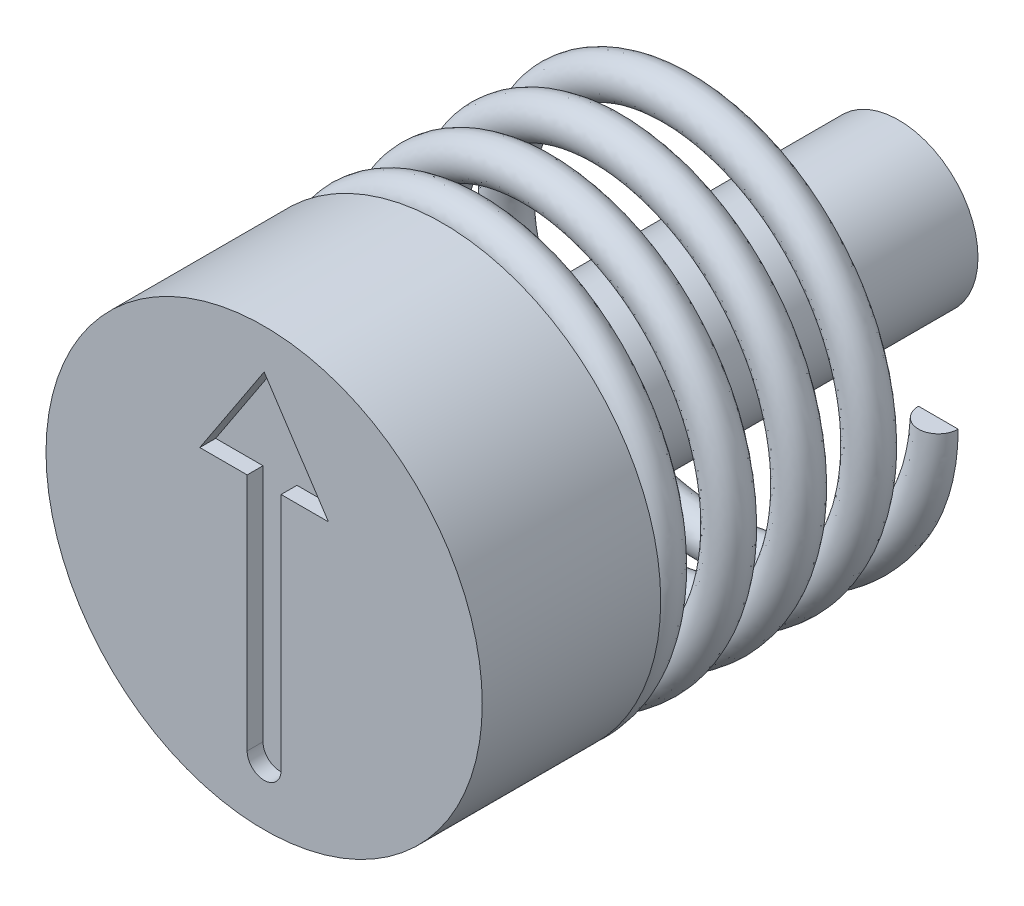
ISO-10303-21;
HEADER;
FILE_DESCRIPTION(('STEP AP214'),'2;1');
FILE_NAME('part.step','',(''),(''),'','','');
FILE_SCHEMA(('AUTOMOTIVE_DESIGN { 1 0 10303 214 1 1 1 1 }'));
ENDSEC;
DATA;
#1=APPLICATION_CONTEXT('core data for automotive mechanical design processes');
#2=APPLICATION_PROTOCOL_DEFINITION('international standard','automotive_design',2000,#1);
#3=PRODUCT_CONTEXT('',#1,'mechanical');
#4=PRODUCT('Part','Part','',(#3));
#5=PRODUCT_RELATED_PRODUCT_CATEGORY('part','',(#4));
#6=PRODUCT_DEFINITION_FORMATION('','',#4);
#7=PRODUCT_DEFINITION_CONTEXT('part definition',#1,'design');
#8=PRODUCT_DEFINITION('design','',#6,#7);
#9=PRODUCT_DEFINITION_SHAPE('','',#8);
#10=(LENGTH_UNIT() NAMED_UNIT(*) SI_UNIT(.MILLI.,.METRE.));
#11=(NAMED_UNIT(*) PLANE_ANGLE_UNIT() SI_UNIT($,.RADIAN.));
#12=(NAMED_UNIT(*) SI_UNIT($,.STERADIAN.) SOLID_ANGLE_UNIT());
#13=UNCERTAINTY_MEASURE_WITH_UNIT(LENGTH_MEASURE(1.E-05),#10,'distance_accuracy_value','');
#14=(GEOMETRIC_REPRESENTATION_CONTEXT(3) GLOBAL_UNCERTAINTY_ASSIGNED_CONTEXT((#13)) GLOBAL_UNIT_ASSIGNED_CONTEXT((#10,
#11,#12)) REPRESENTATION_CONTEXT('',''));
#15=CARTESIAN_POINT('',(0.,0.,0.));
#16=DIRECTION('',(0.,0.,1.));
#17=DIRECTION('',(1.,0.,0.));
#18=AXIS2_PLACEMENT_3D('',#15,#16,#17);
#19=CARTESIAN_POINT('',(5.,0.,-12.5));
#20=DIRECTION('',(0.,-1.,0.));
#21=DIRECTION('',(0.,0.,-1.));
#22=AXIS2_PLACEMENT_3D('',#19,#20,#21);
#23=PLANE('',#22);
#24=CARTESIAN_POINT('',(5.,0.,-12.));
#25=DIRECTION('',(0.,1.,0.));
#26=DIRECTION('',(0.,0.,1.));
#27=AXIS2_PLACEMENT_3D('',#24,#25,#26);
#28=CIRCLE('',#27,0.500000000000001);
#29=CARTESIAN_POINT('',(4.5,0.,-12.));
#30=VERTEX_POINT('',#29);
#31=CARTESIAN_POINT('',(5.5,0.,-12.));
#32=VERTEX_POINT('',#31);
#33=EDGE_CURVE('E88',#30,#32,#28,.T.);
#34=ORIENTED_EDGE('',*,*,#33,.T.);
#35=DIRECTION('',(-1.,0.,0.));
#36=VECTOR('',#35,1.);
#37=CARTESIAN_POINT('',(5.,0.,-12.));
#38=LINE('',#37,#36);
#39=EDGE_CURVE('E75',#32,#30,#38,.T.);
#40=ORIENTED_EDGE('',*,*,#39,.T.);
#41=EDGE_LOOP('',(#34,#40));
#42=FACE_BOUND('',#41,.T.);
#43=ADVANCED_FACE('F49',(#42),#23,.F.);
#44=CARTESIAN_POINT('',(-4.21831895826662E-13,-5.,-4.99999999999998));
#45=DIRECTION('',(-1.,0.,0.));
#46=DIRECTION('',(0.,-1.,0.));
#47=AXIS2_PLACEMENT_3D('',#44,#45,#46);
#48=PLANE('',#47);
#49=DIRECTION('',(0.,-1.,0.));
#50=VECTOR('',#49,1.);
#51=CARTESIAN_POINT('',(-4.21831895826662E-13,-5.,-4.5));
#52=LINE('',#51,#50);
#53=CARTESIAN_POINT('',(-3.79682048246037E-13,-4.5,-4.5));
#54=VERTEX_POINT('',#53);
#55=CARTESIAN_POINT('',(-4.63981743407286E-13,-5.5,-4.5));
#56=VERTEX_POINT('',#55);
#57=EDGE_CURVE('E69',#54,#56,#52,.T.);
#58=ORIENTED_EDGE('',*,*,#57,.F.);
#59=CARTESIAN_POINT('',(-4.21831895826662E-13,-5.,-4.49999999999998));
#60=DIRECTION('',(-1.,0.,0.));
#61=DIRECTION('',(0.,-1.,0.));
#62=AXIS2_PLACEMENT_3D('',#59,#60,#61);
#63=CIRCLE('',#62,0.500000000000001);
#64=EDGE_CURVE('E85',#54,#56,#63,.T.);
#65=ORIENTED_EDGE('',*,*,#64,.T.);
#66=EDGE_LOOP('',(#58,#65));
#67=FACE_BOUND('',#66,.T.);
#68=ADVANCED_FACE('F51',(#67),#48,.T.);
#69=CARTESIAN_POINT('',(5.,0.,-11.5));
#70=CARTESIAN_POINT('',(5.,-1.62459848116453,-11.4117647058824));
#71=CARTESIAN_POINT('',(4.04508497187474,-2.93892626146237,-11.3235294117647));
#72=CARTESIAN_POINT('',(3.09016994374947,-4.2532540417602,-11.2352941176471));
#73=CARTESIAN_POINT('',(1.54508497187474,-4.75528258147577,-11.1470588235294));
#74=CARTESIAN_POINT('',(0.,-5.25731112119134,-11.0588235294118));
#75=CARTESIAN_POINT('',(-1.54508497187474,-4.75528258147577,-10.9705882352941));
#76=CARTESIAN_POINT('',(-3.09016994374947,-4.2532540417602,-10.8823529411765));
#77=CARTESIAN_POINT('',(-4.04508497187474,-2.93892626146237,-10.7941176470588));
#78=CARTESIAN_POINT('',(-5.,-1.62459848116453,-10.7058823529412));
#79=CARTESIAN_POINT('',(-5.,0.,-10.6176470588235));
#80=CARTESIAN_POINT('',(-5.,1.62459848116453,-10.5294117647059));
#81=CARTESIAN_POINT('',(-4.04508497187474,2.93892626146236,-10.4411764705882));
#82=CARTESIAN_POINT('',(-3.09016994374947,4.2532540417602,-10.3529411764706));
#83=CARTESIAN_POINT('',(-1.54508497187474,4.75528258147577,-10.2647058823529));
#84=CARTESIAN_POINT('',(0.,5.25731112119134,-10.1764705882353));
#85=CARTESIAN_POINT('',(1.54508497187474,4.75528258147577,-10.0882352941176));
#86=CARTESIAN_POINT('',(3.09016994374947,4.2532540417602,-10.));
#87=CARTESIAN_POINT('',(4.04508497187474,2.93892626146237,-9.91176470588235));
#88=CARTESIAN_POINT('',(5.,1.62459848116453,-9.8235294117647));
#89=CARTESIAN_POINT('',(5.,0.,-9.73529411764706));
#90=CARTESIAN_POINT('',(5.,-1.62459848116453,-9.64705882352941));
#91=CARTESIAN_POINT('',(4.04508497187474,-2.93892626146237,-9.55882352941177));
#92=CARTESIAN_POINT('',(3.09016994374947,-4.2532540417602,-9.47058823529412));
#93=CARTESIAN_POINT('',(1.54508497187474,-4.75528258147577,-9.38235294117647));
#94=CARTESIAN_POINT('',(0.,-5.25731112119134,-9.29411764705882));
#95=CARTESIAN_POINT('',(-1.54508497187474,-4.75528258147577,-9.20588235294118));
#96=CARTESIAN_POINT('',(-3.09016994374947,-4.2532540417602,-9.11764705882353));
#97=CARTESIAN_POINT('',(-4.04508497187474,-2.93892626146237,-9.02941176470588));
#98=CARTESIAN_POINT('',(-5.,-1.62459848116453,-8.94117647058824));
#99=CARTESIAN_POINT('',(-5.,0.,-8.85294117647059));
#100=CARTESIAN_POINT('',(-5.,1.62459848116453,-8.76470588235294));
#101=CARTESIAN_POINT('',(-4.04508497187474,2.93892626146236,-8.67647058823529));
#102=CARTESIAN_POINT('',(-3.09016994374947,4.2532540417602,-8.58823529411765));
#103=CARTESIAN_POINT('',(-1.54508497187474,4.75528258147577,-8.5));
#104=CARTESIAN_POINT('',(0.,5.25731112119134,-8.41176470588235));
#105=CARTESIAN_POINT('',(1.54508497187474,4.75528258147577,-8.3235294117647));
#106=CARTESIAN_POINT('',(3.09016994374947,4.2532540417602,-8.23529411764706));
#107=CARTESIAN_POINT('',(4.04508497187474,2.93892626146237,-8.14705882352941));
#108=CARTESIAN_POINT('',(5.,1.62459848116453,-8.05882352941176));
#109=CARTESIAN_POINT('',(5.,0.,-7.97058823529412));
#110=CARTESIAN_POINT('',(5.,-1.62459848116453,-7.88235294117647));
#111=CARTESIAN_POINT('',(4.04508497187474,-2.93892626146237,-7.79411764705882));
#112=CARTESIAN_POINT('',(3.09016994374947,-4.2532540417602,-7.70588235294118));
#113=CARTESIAN_POINT('',(1.54508497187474,-4.75528258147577,-7.61764705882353));
#114=CARTESIAN_POINT('',(0.,-5.25731112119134,-7.52941176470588));
#115=CARTESIAN_POINT('',(-1.54508497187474,-4.75528258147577,-7.44117647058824));
#116=CARTESIAN_POINT('',(-3.09016994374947,-4.2532540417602,-7.35294117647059));
#117=CARTESIAN_POINT('',(-4.04508497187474,-2.93892626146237,-7.26470588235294));
#118=CARTESIAN_POINT('',(-5.,-1.62459848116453,-7.17647058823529));
#119=CARTESIAN_POINT('',(-5.,0.,-7.08823529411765));
#120=CARTESIAN_POINT('',(-5.,1.62459848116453,-7.));
#121=CARTESIAN_POINT('',(-4.04508497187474,2.93892626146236,-6.91176470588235));
#122=CARTESIAN_POINT('',(-3.09016994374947,4.2532540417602,-6.82352941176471));
#123=CARTESIAN_POINT('',(-1.54508497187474,4.75528258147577,-6.73529411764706));
#124=CARTESIAN_POINT('',(0.,5.25731112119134,-6.64705882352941));
#125=CARTESIAN_POINT('',(1.54508497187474,4.75528258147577,-6.55882352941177));
#126=CARTESIAN_POINT('',(3.09016994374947,4.2532540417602,-6.47058823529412));
#127=CARTESIAN_POINT('',(4.04508497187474,2.93892626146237,-6.38235294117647));
#128=CARTESIAN_POINT('',(5.,1.62459848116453,-6.29411764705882));
#129=CARTESIAN_POINT('',(5.,0.,-6.20588235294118));
#130=CARTESIAN_POINT('',(5.,-1.62459848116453,-6.11764705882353));
#131=CARTESIAN_POINT('',(4.04508497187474,-2.93892626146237,-6.02941176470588));
#132=CARTESIAN_POINT('',(3.09016994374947,-4.2532540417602,-5.94117647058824));
#133=CARTESIAN_POINT('',(1.54508497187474,-4.75528258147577,-5.85294117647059));
#134=CARTESIAN_POINT('',(0.,-5.25731112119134,-5.76470588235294));
#135=CARTESIAN_POINT('',(-1.54508497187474,-4.75528258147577,-5.6764705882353));
#136=CARTESIAN_POINT('',(-3.09016994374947,-4.2532540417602,-5.58823529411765));
#137=CARTESIAN_POINT('',(-4.04508497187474,-2.93892626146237,-5.5));
#138=CARTESIAN_POINT('',(-5.,-1.62459848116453,-5.41176470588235));
#139=CARTESIAN_POINT('',(-5.,0.,-5.32352941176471));
#140=CARTESIAN_POINT('',(-5.,1.62459848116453,-5.23529411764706));
#141=CARTESIAN_POINT('',(-4.04508497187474,2.93892626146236,-5.14705882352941));
#142=CARTESIAN_POINT('',(-3.09016994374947,4.2532540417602,-5.05882352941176));
#143=CARTESIAN_POINT('',(-1.54508497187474,4.75528258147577,-4.97058823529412));
#144=CARTESIAN_POINT('',(0.,5.25731112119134,-4.88235294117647));
#145=CARTESIAN_POINT('',(1.54508497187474,4.75528258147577,-4.79411764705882));
#146=CARTESIAN_POINT('',(3.09016994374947,4.2532540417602,-4.70588235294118));
#147=CARTESIAN_POINT('',(4.04508497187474,2.93892626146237,-4.61764705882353));
#148=CARTESIAN_POINT('',(5.,1.62459848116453,-4.52941176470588));
#149=CARTESIAN_POINT('',(5.,0.,-4.44117647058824));
#150=CARTESIAN_POINT('',(5.,-1.62459848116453,-4.35294117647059));
#151=CARTESIAN_POINT('',(4.04508497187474,-2.93892626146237,-4.26470588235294));
#152=CARTESIAN_POINT('',(3.09016994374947,-4.2532540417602,-4.1764705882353));
#153=CARTESIAN_POINT('',(1.54508497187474,-4.75528258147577,-4.08823529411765));
#154=CARTESIAN_POINT('',(0.791922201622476,-5.00000000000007,-4.04522436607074));
#155=CARTESIAN_POINT('',(-4.21831895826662E-13,-5.,-3.99999999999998));
#156=CARTESIAN_POINT('',(6.,0.,-11.5));
#157=CARTESIAN_POINT('',(6.,-1.94951817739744,-11.4117647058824));
#158=CARTESIAN_POINT('',(4.85410196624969,-3.52671151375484,-11.3235294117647));
#159=CARTESIAN_POINT('',(3.70820393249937,-5.10390485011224,-11.2352941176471));
#160=CARTESIAN_POINT('',(1.85410196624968,-5.70633909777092,-11.1470588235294));
#161=CARTESIAN_POINT('',(0.,-6.3087733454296,-11.0588235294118));
#162=CARTESIAN_POINT('',(-1.85410196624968,-5.70633909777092,-10.9705882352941));
#163=CARTESIAN_POINT('',(-3.70820393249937,-5.10390485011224,-10.8823529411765));
#164=CARTESIAN_POINT('',(-4.85410196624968,-3.52671151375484,-10.7941176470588));
#165=CARTESIAN_POINT('',(-6.,-1.94951817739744,-10.7058823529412));
#166=CARTESIAN_POINT('',(-6.,0.,-10.6176470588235));
#167=CARTESIAN_POINT('',(-6.,1.94951817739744,-10.5294117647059));
#168=CARTESIAN_POINT('',(-4.85410196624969,3.52671151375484,-10.4411764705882));
#169=CARTESIAN_POINT('',(-3.70820393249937,5.10390485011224,-10.3529411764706));
#170=CARTESIAN_POINT('',(-1.85410196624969,5.70633909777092,-10.2647058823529));
#171=CARTESIAN_POINT('',(0.,6.3087733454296,-10.1764705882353));
#172=CARTESIAN_POINT('',(1.85410196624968,5.70633909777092,-10.0882352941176));
#173=CARTESIAN_POINT('',(3.70820393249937,5.10390485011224,-10.));
#174=CARTESIAN_POINT('',(4.85410196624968,3.52671151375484,-9.91176470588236));
#175=CARTESIAN_POINT('',(6.,1.94951817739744,-9.82352941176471));
#176=CARTESIAN_POINT('',(6.,0.,-9.73529411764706));
#177=CARTESIAN_POINT('',(6.,-1.94951817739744,-9.64705882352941));
#178=CARTESIAN_POINT('',(4.85410196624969,-3.52671151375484,-9.55882352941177));
#179=CARTESIAN_POINT('',(3.70820393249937,-5.10390485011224,-9.47058823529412));
#180=CARTESIAN_POINT('',(1.85410196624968,-5.70633909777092,-9.38235294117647));
#181=CARTESIAN_POINT('',(0.,-6.3087733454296,-9.29411764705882));
#182=CARTESIAN_POINT('',(-1.85410196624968,-5.70633909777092,-9.20588235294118));
#183=CARTESIAN_POINT('',(-3.70820393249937,-5.10390485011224,-9.11764705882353));
#184=CARTESIAN_POINT('',(-4.85410196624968,-3.52671151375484,-9.02941176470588));
#185=CARTESIAN_POINT('',(-6.,-1.94951817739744,-8.94117647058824));
#186=CARTESIAN_POINT('',(-6.,0.,-8.85294117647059));
#187=CARTESIAN_POINT('',(-6.,1.94951817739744,-8.76470588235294));
#188=CARTESIAN_POINT('',(-4.85410196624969,3.52671151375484,-8.6764705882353));
#189=CARTESIAN_POINT('',(-3.70820393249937,5.10390485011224,-8.58823529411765));
#190=CARTESIAN_POINT('',(-1.85410196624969,5.70633909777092,-8.5));
#191=CARTESIAN_POINT('',(0.,6.3087733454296,-8.41176470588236));
#192=CARTESIAN_POINT('',(1.85410196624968,5.70633909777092,-8.32352941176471));
#193=CARTESIAN_POINT('',(3.70820393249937,5.10390485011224,-8.23529411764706));
#194=CARTESIAN_POINT('',(4.85410196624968,3.52671151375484,-8.14705882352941));
#195=CARTESIAN_POINT('',(6.,1.94951817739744,-8.05882352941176));
#196=CARTESIAN_POINT('',(6.,0.,-7.97058823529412));
#197=CARTESIAN_POINT('',(6.,-1.94951817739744,-7.88235294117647));
#198=CARTESIAN_POINT('',(4.85410196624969,-3.52671151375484,-7.79411764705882));
#199=CARTESIAN_POINT('',(3.70820393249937,-5.10390485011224,-7.70588235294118));
#200=CARTESIAN_POINT('',(1.85410196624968,-5.70633909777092,-7.61764705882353));
#201=CARTESIAN_POINT('',(0.,-6.3087733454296,-7.52941176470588));
#202=CARTESIAN_POINT('',(-1.85410196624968,-5.70633909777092,-7.44117647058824));
#203=CARTESIAN_POINT('',(-3.70820393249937,-5.10390485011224,-7.35294117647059));
#204=CARTESIAN_POINT('',(-4.85410196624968,-3.52671151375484,-7.26470588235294));
#205=CARTESIAN_POINT('',(-6.,-1.94951817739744,-7.1764705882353));
#206=CARTESIAN_POINT('',(-6.,0.,-7.08823529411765));
#207=CARTESIAN_POINT('',(-6.,1.94951817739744,-7.));
#208=CARTESIAN_POINT('',(-4.85410196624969,3.52671151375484,-6.91176470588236));
#209=CARTESIAN_POINT('',(-3.70820393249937,5.10390485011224,-6.82352941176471));
#210=CARTESIAN_POINT('',(-1.85410196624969,5.70633909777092,-6.73529411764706));
#211=CARTESIAN_POINT('',(0.,6.3087733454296,-6.64705882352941));
#212=CARTESIAN_POINT('',(1.85410196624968,5.70633909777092,-6.55882352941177));
#213=CARTESIAN_POINT('',(3.70820393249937,5.10390485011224,-6.47058823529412));
#214=CARTESIAN_POINT('',(4.85410196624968,3.52671151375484,-6.38235294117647));
#215=CARTESIAN_POINT('',(6.,1.94951817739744,-6.29411764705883));
#216=CARTESIAN_POINT('',(6.,0.,-6.20588235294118));
#217=CARTESIAN_POINT('',(6.,-1.94951817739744,-6.11764705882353));
#218=CARTESIAN_POINT('',(4.85410196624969,-3.52671151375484,-6.02941176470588));
#219=CARTESIAN_POINT('',(3.70820393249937,-5.10390485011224,-5.94117647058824));
#220=CARTESIAN_POINT('',(1.85410196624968,-5.70633909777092,-5.85294117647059));
#221=CARTESIAN_POINT('',(0.,-6.3087733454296,-5.76470588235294));
#222=CARTESIAN_POINT('',(-1.85410196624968,-5.70633909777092,-5.6764705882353));
#223=CARTESIAN_POINT('',(-3.70820393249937,-5.10390485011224,-5.58823529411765));
#224=CARTESIAN_POINT('',(-4.85410196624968,-3.52671151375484,-5.5));
#225=CARTESIAN_POINT('',(-6.,-1.94951817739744,-5.41176470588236));
#226=CARTESIAN_POINT('',(-6.,0.,-5.32352941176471));
#227=CARTESIAN_POINT('',(-6.,1.94951817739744,-5.23529411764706));
#228=CARTESIAN_POINT('',(-4.85410196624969,3.52671151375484,-5.14705882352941));
#229=CARTESIAN_POINT('',(-3.70820393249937,5.10390485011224,-5.05882352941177));
#230=CARTESIAN_POINT('',(-1.85410196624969,5.70633909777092,-4.97058823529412));
#231=CARTESIAN_POINT('',(0.,6.3087733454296,-4.88235294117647));
#232=CARTESIAN_POINT('',(1.85410196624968,5.70633909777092,-4.79411764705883));
#233=CARTESIAN_POINT('',(3.70820393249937,5.10390485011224,-4.70588235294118));
#234=CARTESIAN_POINT('',(4.85410196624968,3.52671151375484,-4.61764705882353));
#235=CARTESIAN_POINT('',(6.,1.94951817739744,-4.52941176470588));
#236=CARTESIAN_POINT('',(6.,0.,-4.44117647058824));
#237=CARTESIAN_POINT('',(6.,-1.94951817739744,-4.35294117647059));
#238=CARTESIAN_POINT('',(4.85410196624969,-3.52671151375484,-4.26470588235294));
#239=CARTESIAN_POINT('',(3.70820393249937,-5.10390485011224,-4.1764705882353));
#240=CARTESIAN_POINT('',(1.85410196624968,-5.70633909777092,-4.08823529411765));
#241=CARTESIAN_POINT('',(0.950306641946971,-6.00000000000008,-4.04522436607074));
#242=CARTESIAN_POINT('',(-5.06131590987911E-13,-6.,-3.99999999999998));
#243=CARTESIAN_POINT('',(6.,0.,-12.5));
#244=CARTESIAN_POINT('',(6.,-1.94951817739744,-12.4117647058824));
#245=CARTESIAN_POINT('',(4.85410196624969,-3.52671151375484,-12.3235294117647));
#246=CARTESIAN_POINT('',(3.70820393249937,-5.10390485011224,-12.2352941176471));
#247=CARTESIAN_POINT('',(1.85410196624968,-5.70633909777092,-12.1470588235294));
#248=CARTESIAN_POINT('',(0.,-6.3087733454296,-12.0588235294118));
#249=CARTESIAN_POINT('',(-1.85410196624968,-5.70633909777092,-11.9705882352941));
#250=CARTESIAN_POINT('',(-3.70820393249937,-5.10390485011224,-11.8823529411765));
#251=CARTESIAN_POINT('',(-4.85410196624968,-3.52671151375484,-11.7941176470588));
#252=CARTESIAN_POINT('',(-6.,-1.94951817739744,-11.7058823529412));
#253=CARTESIAN_POINT('',(-6.,0.,-11.6176470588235));
#254=CARTESIAN_POINT('',(-6.,1.94951817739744,-11.5294117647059));
#255=CARTESIAN_POINT('',(-4.85410196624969,3.52671151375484,-11.4411764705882));
#256=CARTESIAN_POINT('',(-3.70820393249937,5.10390485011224,-11.3529411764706));
#257=CARTESIAN_POINT('',(-1.85410196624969,5.70633909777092,-11.2647058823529));
#258=CARTESIAN_POINT('',(0.,6.3087733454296,-11.1764705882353));
#259=CARTESIAN_POINT('',(1.85410196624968,5.70633909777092,-11.0882352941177));
#260=CARTESIAN_POINT('',(3.70820393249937,5.10390485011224,-11.));
#261=CARTESIAN_POINT('',(4.85410196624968,3.52671151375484,-10.9117647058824));
#262=CARTESIAN_POINT('',(6.,1.94951817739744,-10.8235294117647));
#263=CARTESIAN_POINT('',(6.,0.,-10.7352941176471));
#264=CARTESIAN_POINT('',(6.,-1.94951817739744,-10.6470588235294));
#265=CARTESIAN_POINT('',(4.85410196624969,-3.52671151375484,-10.5588235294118));
#266=CARTESIAN_POINT('',(3.70820393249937,-5.10390485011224,-10.4705882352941));
#267=CARTESIAN_POINT('',(1.85410196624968,-5.70633909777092,-10.3823529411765));
#268=CARTESIAN_POINT('',(0.,-6.3087733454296,-10.2941176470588));
#269=CARTESIAN_POINT('',(-1.85410196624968,-5.70633909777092,-10.2058823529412));
#270=CARTESIAN_POINT('',(-3.70820393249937,-5.10390485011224,-10.1176470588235));
#271=CARTESIAN_POINT('',(-4.85410196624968,-3.52671151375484,-10.0294117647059));
#272=CARTESIAN_POINT('',(-6.,-1.94951817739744,-9.94117647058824));
#273=CARTESIAN_POINT('',(-6.,0.,-9.85294117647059));
#274=CARTESIAN_POINT('',(-6.,1.94951817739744,-9.76470588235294));
#275=CARTESIAN_POINT('',(-4.85410196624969,3.52671151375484,-9.6764705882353));
#276=CARTESIAN_POINT('',(-3.70820393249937,5.10390485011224,-9.58823529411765));
#277=CARTESIAN_POINT('',(-1.85410196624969,5.70633909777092,-9.5));
#278=CARTESIAN_POINT('',(0.,6.3087733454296,-9.41176470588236));
#279=CARTESIAN_POINT('',(1.85410196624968,5.70633909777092,-9.32352941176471));
#280=CARTESIAN_POINT('',(3.70820393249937,5.10390485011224,-9.23529411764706));
#281=CARTESIAN_POINT('',(4.85410196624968,3.52671151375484,-9.14705882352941));
#282=CARTESIAN_POINT('',(6.,1.94951817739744,-9.05882352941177));
#283=CARTESIAN_POINT('',(6.,0.,-8.97058823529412));
#284=CARTESIAN_POINT('',(6.,-1.94951817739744,-8.88235294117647));
#285=CARTESIAN_POINT('',(4.85410196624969,-3.52671151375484,-8.79411764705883));
#286=CARTESIAN_POINT('',(3.70820393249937,-5.10390485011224,-8.70588235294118));
#287=CARTESIAN_POINT('',(1.85410196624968,-5.70633909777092,-8.61764705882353));
#288=CARTESIAN_POINT('',(0.,-6.3087733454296,-8.52941176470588));
#289=CARTESIAN_POINT('',(-1.85410196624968,-5.70633909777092,-8.44117647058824));
#290=CARTESIAN_POINT('',(-3.70820393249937,-5.10390485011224,-8.35294117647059));
#291=CARTESIAN_POINT('',(-4.85410196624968,-3.52671151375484,-8.26470588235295));
#292=CARTESIAN_POINT('',(-6.,-1.94951817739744,-8.1764705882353));
#293=CARTESIAN_POINT('',(-6.,0.,-8.08823529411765));
#294=CARTESIAN_POINT('',(-6.,1.94951817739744,-8.));
#295=CARTESIAN_POINT('',(-4.85410196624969,3.52671151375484,-7.91176470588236));
#296=CARTESIAN_POINT('',(-3.70820393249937,5.10390485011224,-7.82352941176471));
#297=CARTESIAN_POINT('',(-1.85410196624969,5.70633909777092,-7.73529411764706));
#298=CARTESIAN_POINT('',(0.,6.3087733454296,-7.64705882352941));
#299=CARTESIAN_POINT('',(1.85410196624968,5.70633909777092,-7.55882352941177));
#300=CARTESIAN_POINT('',(3.70820393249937,5.10390485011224,-7.47058823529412));
#301=CARTESIAN_POINT('',(4.85410196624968,3.52671151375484,-7.38235294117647));
#302=CARTESIAN_POINT('',(6.,1.94951817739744,-7.29411764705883));
#303=CARTESIAN_POINT('',(6.,0.,-7.20588235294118));
#304=CARTESIAN_POINT('',(6.,-1.94951817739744,-7.11764705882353));
#305=CARTESIAN_POINT('',(4.85410196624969,-3.52671151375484,-7.02941176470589));
#306=CARTESIAN_POINT('',(3.70820393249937,-5.10390485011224,-6.94117647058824));
#307=CARTESIAN_POINT('',(1.85410196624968,-5.70633909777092,-6.85294117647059));
#308=CARTESIAN_POINT('',(0.,-6.3087733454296,-6.76470588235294));
#309=CARTESIAN_POINT('',(-1.85410196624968,-5.70633909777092,-6.6764705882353));
#310=CARTESIAN_POINT('',(-3.70820393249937,-5.10390485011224,-6.58823529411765));
#311=CARTESIAN_POINT('',(-4.85410196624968,-3.52671151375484,-6.5));
#312=CARTESIAN_POINT('',(-6.,-1.94951817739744,-6.41176470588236));
#313=CARTESIAN_POINT('',(-6.,0.,-6.32352941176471));
#314=CARTESIAN_POINT('',(-6.,1.94951817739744,-6.23529411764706));
#315=CARTESIAN_POINT('',(-4.85410196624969,3.52671151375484,-6.14705882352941));
#316=CARTESIAN_POINT('',(-3.70820393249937,5.10390485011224,-6.05882352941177));
#317=CARTESIAN_POINT('',(-1.85410196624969,5.70633909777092,-5.97058823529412));
#318=CARTESIAN_POINT('',(0.,6.3087733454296,-5.88235294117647));
#319=CARTESIAN_POINT('',(1.85410196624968,5.70633909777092,-5.79411764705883));
#320=CARTESIAN_POINT('',(3.70820393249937,5.10390485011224,-5.70588235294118));
#321=CARTESIAN_POINT('',(4.85410196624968,3.52671151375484,-5.61764705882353));
#322=CARTESIAN_POINT('',(6.,1.94951817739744,-5.52941176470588));
#323=CARTESIAN_POINT('',(6.,0.,-5.44117647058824));
#324=CARTESIAN_POINT('',(6.,-1.94951817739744,-5.35294117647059));
#325=CARTESIAN_POINT('',(4.85410196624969,-3.52671151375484,-5.26470588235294));
#326=CARTESIAN_POINT('',(3.70820393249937,-5.10390485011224,-5.1764705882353));
#327=CARTESIAN_POINT('',(1.85410196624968,-5.70633909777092,-5.08823529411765));
#328=CARTESIAN_POINT('',(0.950306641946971,-6.00000000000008,-5.04522436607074));
#329=CARTESIAN_POINT('',(-5.06131590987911E-13,-6.,-4.99999999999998));
#330=CARTESIAN_POINT('',(5.,0.,-12.5));
#331=CARTESIAN_POINT('',(5.,-1.62459848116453,-12.4117647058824));
#332=CARTESIAN_POINT('',(4.04508497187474,-2.93892626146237,-12.3235294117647));
#333=CARTESIAN_POINT('',(3.09016994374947,-4.2532540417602,-12.2352941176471));
#334=CARTESIAN_POINT('',(1.54508497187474,-4.75528258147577,-12.1470588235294));
#335=CARTESIAN_POINT('',(0.,-5.25731112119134,-12.0588235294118));
#336=CARTESIAN_POINT('',(-1.54508497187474,-4.75528258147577,-11.9705882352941));
#337=CARTESIAN_POINT('',(-3.09016994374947,-4.2532540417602,-11.8823529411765));
#338=CARTESIAN_POINT('',(-4.04508497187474,-2.93892626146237,-11.7941176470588));
#339=CARTESIAN_POINT('',(-5.,-1.62459848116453,-11.7058823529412));
#340=CARTESIAN_POINT('',(-5.,0.,-11.6176470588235));
#341=CARTESIAN_POINT('',(-5.,1.62459848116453,-11.5294117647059));
#342=CARTESIAN_POINT('',(-4.04508497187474,2.93892626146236,-11.4411764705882));
#343=CARTESIAN_POINT('',(-3.09016994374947,4.2532540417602,-11.3529411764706));
#344=CARTESIAN_POINT('',(-1.54508497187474,4.75528258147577,-11.2647058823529));
#345=CARTESIAN_POINT('',(0.,5.25731112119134,-11.1764705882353));
#346=CARTESIAN_POINT('',(1.54508497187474,4.75528258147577,-11.0882352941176));
#347=CARTESIAN_POINT('',(3.09016994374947,4.2532540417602,-11.));
#348=CARTESIAN_POINT('',(4.04508497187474,2.93892626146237,-10.9117647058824));
#349=CARTESIAN_POINT('',(5.,1.62459848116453,-10.8235294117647));
#350=CARTESIAN_POINT('',(5.,0.,-10.7352941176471));
#351=CARTESIAN_POINT('',(5.,-1.62459848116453,-10.6470588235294));
#352=CARTESIAN_POINT('',(4.04508497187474,-2.93892626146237,-10.5588235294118));
#353=CARTESIAN_POINT('',(3.09016994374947,-4.2532540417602,-10.4705882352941));
#354=CARTESIAN_POINT('',(1.54508497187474,-4.75528258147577,-10.3823529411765));
#355=CARTESIAN_POINT('',(0.,-5.25731112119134,-10.2941176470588));
#356=CARTESIAN_POINT('',(-1.54508497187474,-4.75528258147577,-10.2058823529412));
#357=CARTESIAN_POINT('',(-3.09016994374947,-4.2532540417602,-10.1176470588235));
#358=CARTESIAN_POINT('',(-4.04508497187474,-2.93892626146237,-10.0294117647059));
#359=CARTESIAN_POINT('',(-5.,-1.62459848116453,-9.94117647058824));
#360=CARTESIAN_POINT('',(-5.,0.,-9.85294117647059));
#361=CARTESIAN_POINT('',(-5.,1.62459848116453,-9.76470588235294));
#362=CARTESIAN_POINT('',(-4.04508497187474,2.93892626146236,-9.6764705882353));
#363=CARTESIAN_POINT('',(-3.09016994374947,4.2532540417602,-9.58823529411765));
#364=CARTESIAN_POINT('',(-1.54508497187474,4.75528258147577,-9.5));
#365=CARTESIAN_POINT('',(0.,5.25731112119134,-9.41176470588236));
#366=CARTESIAN_POINT('',(1.54508497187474,4.75528258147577,-9.32352941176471));
#367=CARTESIAN_POINT('',(3.09016994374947,4.2532540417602,-9.23529411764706));
#368=CARTESIAN_POINT('',(4.04508497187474,2.93892626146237,-9.14705882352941));
#369=CARTESIAN_POINT('',(5.,1.62459848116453,-9.05882352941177));
#370=CARTESIAN_POINT('',(5.,0.,-8.97058823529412));
#371=CARTESIAN_POINT('',(5.,-1.62459848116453,-8.88235294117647));
#372=CARTESIAN_POINT('',(4.04508497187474,-2.93892626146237,-8.79411764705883));
#373=CARTESIAN_POINT('',(3.09016994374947,-4.2532540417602,-8.70588235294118));
#374=CARTESIAN_POINT('',(1.54508497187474,-4.75528258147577,-8.61764705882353));
#375=CARTESIAN_POINT('',(0.,-5.25731112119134,-8.52941176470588));
#376=CARTESIAN_POINT('',(-1.54508497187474,-4.75528258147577,-8.44117647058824));
#377=CARTESIAN_POINT('',(-3.09016994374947,-4.2532540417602,-8.35294117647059));
#378=CARTESIAN_POINT('',(-4.04508497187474,-2.93892626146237,-8.26470588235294));
#379=CARTESIAN_POINT('',(-5.,-1.62459848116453,-8.1764705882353));
#380=CARTESIAN_POINT('',(-5.,0.,-8.08823529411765));
#381=CARTESIAN_POINT('',(-5.,1.62459848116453,-8.));
#382=CARTESIAN_POINT('',(-4.04508497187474,2.93892626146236,-7.91176470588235));
#383=CARTESIAN_POINT('',(-3.09016994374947,4.2532540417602,-7.82352941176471));
#384=CARTESIAN_POINT('',(-1.54508497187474,4.75528258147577,-7.73529411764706));
#385=CARTESIAN_POINT('',(0.,5.25731112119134,-7.64705882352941));
#386=CARTESIAN_POINT('',(1.54508497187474,4.75528258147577,-7.55882352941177));
#387=CARTESIAN_POINT('',(3.09016994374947,4.2532540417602,-7.47058823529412));
#388=CARTESIAN_POINT('',(4.04508497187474,2.93892626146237,-7.38235294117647));
#389=CARTESIAN_POINT('',(5.,1.62459848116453,-7.29411764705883));
#390=CARTESIAN_POINT('',(5.,0.,-7.20588235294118));
#391=CARTESIAN_POINT('',(5.,-1.62459848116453,-7.11764705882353));
#392=CARTESIAN_POINT('',(4.04508497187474,-2.93892626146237,-7.02941176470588));
#393=CARTESIAN_POINT('',(3.09016994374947,-4.2532540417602,-6.94117647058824));
#394=CARTESIAN_POINT('',(1.54508497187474,-4.75528258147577,-6.85294117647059));
#395=CARTESIAN_POINT('',(0.,-5.25731112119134,-6.76470588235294));
#396=CARTESIAN_POINT('',(-1.54508497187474,-4.75528258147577,-6.6764705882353));
#397=CARTESIAN_POINT('',(-3.09016994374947,-4.2532540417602,-6.58823529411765));
#398=CARTESIAN_POINT('',(-4.04508497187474,-2.93892626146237,-6.5));
#399=CARTESIAN_POINT('',(-5.,-1.62459848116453,-6.41176470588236));
#400=CARTESIAN_POINT('',(-5.,0.,-6.32352941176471));
#401=CARTESIAN_POINT('',(-5.,1.62459848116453,-6.23529411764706));
#402=CARTESIAN_POINT('',(-4.04508497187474,2.93892626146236,-6.14705882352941));
#403=CARTESIAN_POINT('',(-3.09016994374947,4.2532540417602,-6.05882352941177));
#404=CARTESIAN_POINT('',(-1.54508497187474,4.75528258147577,-5.97058823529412));
#405=CARTESIAN_POINT('',(0.,5.25731112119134,-5.88235294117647));
#406=CARTESIAN_POINT('',(1.54508497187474,4.75528258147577,-5.79411764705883));
#407=CARTESIAN_POINT('',(3.09016994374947,4.2532540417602,-5.70588235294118));
#408=CARTESIAN_POINT('',(4.04508497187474,2.93892626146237,-5.61764705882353));
#409=CARTESIAN_POINT('',(5.,1.62459848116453,-5.52941176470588));
#410=CARTESIAN_POINT('',(5.,0.,-5.44117647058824));
#411=CARTESIAN_POINT('',(5.,-1.62459848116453,-5.35294117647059));
#412=CARTESIAN_POINT('',(4.04508497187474,-2.93892626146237,-5.26470588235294));
#413=CARTESIAN_POINT('',(3.09016994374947,-4.2532540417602,-5.1764705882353));
#414=CARTESIAN_POINT('',(1.54508497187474,-4.75528258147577,-5.08823529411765));
#415=CARTESIAN_POINT('',(0.791922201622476,-5.00000000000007,-5.04522436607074));
#416=CARTESIAN_POINT('',(-4.21831895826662E-13,-5.,-4.99999999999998));
#417=CARTESIAN_POINT('',(4.,0.,-12.5));
#418=CARTESIAN_POINT('',(4.,-1.29967878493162,-12.4117647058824));
#419=CARTESIAN_POINT('',(3.23606797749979,-2.35114100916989,-12.3235294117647));
#420=CARTESIAN_POINT('',(2.47213595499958,-3.40260323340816,-12.2352941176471));
#421=CARTESIAN_POINT('',(1.23606797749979,-3.80422606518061,-12.1470588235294));
#422=CARTESIAN_POINT('',(0.,-4.20584889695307,-12.0588235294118));
#423=CARTESIAN_POINT('',(-1.23606797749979,-3.80422606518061,-11.9705882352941));
#424=CARTESIAN_POINT('',(-2.47213595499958,-3.40260323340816,-11.8823529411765));
#425=CARTESIAN_POINT('',(-3.23606797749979,-2.35114100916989,-11.7941176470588));
#426=CARTESIAN_POINT('',(-4.,-1.29967878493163,-11.7058823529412));
#427=CARTESIAN_POINT('',(-4.,0.,-11.6176470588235));
#428=CARTESIAN_POINT('',(-4.,1.29967878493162,-11.5294117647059));
#429=CARTESIAN_POINT('',(-3.23606797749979,2.35114100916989,-11.4411764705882));
#430=CARTESIAN_POINT('',(-2.47213595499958,3.40260323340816,-11.3529411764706));
#431=CARTESIAN_POINT('',(-1.23606797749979,3.80422606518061,-11.2647058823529));
#432=CARTESIAN_POINT('',(0.,4.20584889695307,-11.1764705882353));
#433=CARTESIAN_POINT('',(1.23606797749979,3.80422606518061,-11.0882352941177));
#434=CARTESIAN_POINT('',(2.47213595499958,3.40260323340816,-11.));
#435=CARTESIAN_POINT('',(3.23606797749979,2.35114100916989,-10.9117647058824));
#436=CARTESIAN_POINT('',(4.,1.29967878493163,-10.8235294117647));
#437=CARTESIAN_POINT('',(4.,0.,-10.7352941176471));
#438=CARTESIAN_POINT('',(4.,-1.29967878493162,-10.6470588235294));
#439=CARTESIAN_POINT('',(3.23606797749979,-2.35114100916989,-10.5588235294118));
#440=CARTESIAN_POINT('',(2.47213595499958,-3.40260323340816,-10.4705882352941));
#441=CARTESIAN_POINT('',(1.23606797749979,-3.80422606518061,-10.3823529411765));
#442=CARTESIAN_POINT('',(0.,-4.20584889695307,-10.2941176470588));
#443=CARTESIAN_POINT('',(-1.23606797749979,-3.80422606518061,-10.2058823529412));
#444=CARTESIAN_POINT('',(-2.47213595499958,-3.40260323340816,-10.1176470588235));
#445=CARTESIAN_POINT('',(-3.23606797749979,-2.35114100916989,-10.0294117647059));
#446=CARTESIAN_POINT('',(-4.,-1.29967878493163,-9.94117647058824));
#447=CARTESIAN_POINT('',(-4.,0.,-9.85294117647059));
#448=CARTESIAN_POINT('',(-4.,1.29967878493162,-9.76470588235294));
#449=CARTESIAN_POINT('',(-3.23606797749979,2.35114100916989,-9.6764705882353));
#450=CARTESIAN_POINT('',(-2.47213595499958,3.40260323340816,-9.58823529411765));
#451=CARTESIAN_POINT('',(-1.23606797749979,3.80422606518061,-9.5));
#452=CARTESIAN_POINT('',(0.,4.20584889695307,-9.41176470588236));
#453=CARTESIAN_POINT('',(1.23606797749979,3.80422606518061,-9.32352941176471));
#454=CARTESIAN_POINT('',(2.47213595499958,3.40260323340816,-9.23529411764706));
#455=CARTESIAN_POINT('',(3.23606797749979,2.35114100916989,-9.14705882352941));
#456=CARTESIAN_POINT('',(4.,1.29967878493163,-9.05882352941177));
#457=CARTESIAN_POINT('',(4.,0.,-8.97058823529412));
#458=CARTESIAN_POINT('',(4.,-1.29967878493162,-8.88235294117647));
#459=CARTESIAN_POINT('',(3.23606797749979,-2.35114100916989,-8.79411764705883));
#460=CARTESIAN_POINT('',(2.47213595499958,-3.40260323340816,-8.70588235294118));
#461=CARTESIAN_POINT('',(1.23606797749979,-3.80422606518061,-8.61764705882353));
#462=CARTESIAN_POINT('',(0.,-4.20584889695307,-8.52941176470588));
#463=CARTESIAN_POINT('',(-1.23606797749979,-3.80422606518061,-8.44117647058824));
#464=CARTESIAN_POINT('',(-2.47213595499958,-3.40260323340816,-8.35294117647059));
#465=CARTESIAN_POINT('',(-3.23606797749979,-2.35114100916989,-8.26470588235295));
#466=CARTESIAN_POINT('',(-4.,-1.29967878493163,-8.1764705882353));
#467=CARTESIAN_POINT('',(-4.,0.,-8.08823529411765));
#468=CARTESIAN_POINT('',(-4.,1.29967878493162,-8.));
#469=CARTESIAN_POINT('',(-3.23606797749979,2.35114100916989,-7.91176470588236));
#470=CARTESIAN_POINT('',(-2.47213595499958,3.40260323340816,-7.82352941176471));
#471=CARTESIAN_POINT('',(-1.23606797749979,3.80422606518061,-7.73529411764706));
#472=CARTESIAN_POINT('',(0.,4.20584889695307,-7.64705882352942));
#473=CARTESIAN_POINT('',(1.23606797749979,3.80422606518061,-7.55882352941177));
#474=CARTESIAN_POINT('',(2.47213595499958,3.40260323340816,-7.47058823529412));
#475=CARTESIAN_POINT('',(3.23606797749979,2.35114100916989,-7.38235294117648));
#476=CARTESIAN_POINT('',(4.,1.29967878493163,-7.29411764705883));
#477=CARTESIAN_POINT('',(4.,0.,-7.20588235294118));
#478=CARTESIAN_POINT('',(4.,-1.29967878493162,-7.11764705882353));
#479=CARTESIAN_POINT('',(3.23606797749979,-2.35114100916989,-7.02941176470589));
#480=CARTESIAN_POINT('',(2.47213595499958,-3.40260323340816,-6.94117647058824));
#481=CARTESIAN_POINT('',(1.23606797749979,-3.80422606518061,-6.85294117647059));
#482=CARTESIAN_POINT('',(0.,-4.20584889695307,-6.76470588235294));
#483=CARTESIAN_POINT('',(-1.23606797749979,-3.80422606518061,-6.6764705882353));
#484=CARTESIAN_POINT('',(-2.47213595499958,-3.40260323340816,-6.58823529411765));
#485=CARTESIAN_POINT('',(-3.23606797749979,-2.35114100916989,-6.5));
#486=CARTESIAN_POINT('',(-4.,-1.29967878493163,-6.41176470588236));
#487=CARTESIAN_POINT('',(-4.,0.,-6.32352941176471));
#488=CARTESIAN_POINT('',(-4.,1.29967878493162,-6.23529411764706));
#489=CARTESIAN_POINT('',(-3.23606797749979,2.35114100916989,-6.14705882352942));
#490=CARTESIAN_POINT('',(-2.47213595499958,3.40260323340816,-6.05882352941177));
#491=CARTESIAN_POINT('',(-1.23606797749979,3.80422606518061,-5.97058823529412));
#492=CARTESIAN_POINT('',(0.,4.20584889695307,-5.88235294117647));
#493=CARTESIAN_POINT('',(1.23606797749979,3.80422606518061,-5.79411764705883));
#494=CARTESIAN_POINT('',(2.47213595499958,3.40260323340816,-5.70588235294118));
#495=CARTESIAN_POINT('',(3.23606797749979,2.35114100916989,-5.61764705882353));
#496=CARTESIAN_POINT('',(4.,1.29967878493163,-5.52941176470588));
#497=CARTESIAN_POINT('',(4.,0.,-5.44117647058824));
#498=CARTESIAN_POINT('',(4.,-1.29967878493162,-5.35294117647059));
#499=CARTESIAN_POINT('',(3.23606797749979,-2.35114100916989,-5.26470588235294));
#500=CARTESIAN_POINT('',(2.47213595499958,-3.40260323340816,-5.1764705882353));
#501=CARTESIAN_POINT('',(1.23606797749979,-3.80422606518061,-5.08823529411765));
#502=CARTESIAN_POINT('',(0.633537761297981,-4.00000000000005,-5.04522436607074));
#503=CARTESIAN_POINT('',(-3.37296028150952E-13,-4.,-4.99999999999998));
#504=CARTESIAN_POINT('',(4.,0.,-11.5));
#505=CARTESIAN_POINT('',(4.,-1.29967878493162,-11.4117647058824));
#506=CARTESIAN_POINT('',(3.23606797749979,-2.35114100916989,-11.3235294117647));
#507=CARTESIAN_POINT('',(2.47213595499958,-3.40260323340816,-11.2352941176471));
#508=CARTESIAN_POINT('',(1.23606797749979,-3.80422606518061,-11.1470588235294));
#509=CARTESIAN_POINT('',(0.,-4.20584889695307,-11.0588235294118));
#510=CARTESIAN_POINT('',(-1.23606797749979,-3.80422606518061,-10.9705882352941));
#511=CARTESIAN_POINT('',(-2.47213595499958,-3.40260323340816,-10.8823529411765));
#512=CARTESIAN_POINT('',(-3.23606797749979,-2.35114100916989,-10.7941176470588));
#513=CARTESIAN_POINT('',(-4.,-1.29967878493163,-10.7058823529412));
#514=CARTESIAN_POINT('',(-4.,0.,-10.6176470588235));
#515=CARTESIAN_POINT('',(-4.,1.29967878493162,-10.5294117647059));
#516=CARTESIAN_POINT('',(-3.23606797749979,2.35114100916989,-10.4411764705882));
#517=CARTESIAN_POINT('',(-2.47213595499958,3.40260323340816,-10.3529411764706));
#518=CARTESIAN_POINT('',(-1.23606797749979,3.80422606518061,-10.2647058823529));
#519=CARTESIAN_POINT('',(0.,4.20584889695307,-10.1764705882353));
#520=CARTESIAN_POINT('',(1.23606797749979,3.80422606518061,-10.0882352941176));
#521=CARTESIAN_POINT('',(2.47213595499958,3.40260323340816,-10.));
#522=CARTESIAN_POINT('',(3.23606797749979,2.35114100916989,-9.91176470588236));
#523=CARTESIAN_POINT('',(4.,1.29967878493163,-9.82352941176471));
#524=CARTESIAN_POINT('',(4.,0.,-9.73529411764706));
#525=CARTESIAN_POINT('',(4.,-1.29967878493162,-9.64705882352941));
#526=CARTESIAN_POINT('',(3.23606797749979,-2.35114100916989,-9.55882352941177));
#527=CARTESIAN_POINT('',(2.47213595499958,-3.40260323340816,-9.47058823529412));
#528=CARTESIAN_POINT('',(1.23606797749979,-3.80422606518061,-9.38235294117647));
#529=CARTESIAN_POINT('',(0.,-4.20584889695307,-9.29411764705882));
#530=CARTESIAN_POINT('',(-1.23606797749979,-3.80422606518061,-9.20588235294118));
#531=CARTESIAN_POINT('',(-2.47213595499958,-3.40260323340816,-9.11764705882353));
#532=CARTESIAN_POINT('',(-3.23606797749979,-2.35114100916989,-9.02941176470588));
#533=CARTESIAN_POINT('',(-4.,-1.29967878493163,-8.94117647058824));
#534=CARTESIAN_POINT('',(-4.,0.,-8.85294117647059));
#535=CARTESIAN_POINT('',(-4.,1.29967878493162,-8.76470588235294));
#536=CARTESIAN_POINT('',(-3.23606797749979,2.35114100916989,-8.6764705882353));
#537=CARTESIAN_POINT('',(-2.47213595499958,3.40260323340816,-8.58823529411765));
#538=CARTESIAN_POINT('',(-1.23606797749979,3.80422606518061,-8.5));
#539=CARTESIAN_POINT('',(0.,4.20584889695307,-8.41176470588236));
#540=CARTESIAN_POINT('',(1.23606797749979,3.80422606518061,-8.32352941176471));
#541=CARTESIAN_POINT('',(2.47213595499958,3.40260323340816,-8.23529411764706));
#542=CARTESIAN_POINT('',(3.23606797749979,2.35114100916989,-8.14705882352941));
#543=CARTESIAN_POINT('',(4.,1.29967878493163,-8.05882352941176));
#544=CARTESIAN_POINT('',(4.,0.,-7.97058823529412));
#545=CARTESIAN_POINT('',(4.,-1.29967878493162,-7.88235294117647));
#546=CARTESIAN_POINT('',(3.23606797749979,-2.35114100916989,-7.79411764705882));
#547=CARTESIAN_POINT('',(2.47213595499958,-3.40260323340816,-7.70588235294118));
#548=CARTESIAN_POINT('',(1.23606797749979,-3.80422606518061,-7.61764705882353));
#549=CARTESIAN_POINT('',(0.,-4.20584889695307,-7.52941176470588));
#550=CARTESIAN_POINT('',(-1.23606797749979,-3.80422606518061,-7.44117647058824));
#551=CARTESIAN_POINT('',(-2.47213595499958,-3.40260323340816,-7.35294117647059));
#552=CARTESIAN_POINT('',(-3.23606797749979,-2.35114100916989,-7.26470588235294));
#553=CARTESIAN_POINT('',(-4.,-1.29967878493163,-7.1764705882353));
#554=CARTESIAN_POINT('',(-4.,0.,-7.08823529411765));
#555=CARTESIAN_POINT('',(-4.,1.29967878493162,-7.));
#556=CARTESIAN_POINT('',(-3.23606797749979,2.35114100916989,-6.91176470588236));
#557=CARTESIAN_POINT('',(-2.47213595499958,3.40260323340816,-6.82352941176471));
#558=CARTESIAN_POINT('',(-1.23606797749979,3.80422606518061,-6.73529411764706));
#559=CARTESIAN_POINT('',(0.,4.20584889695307,-6.64705882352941));
#560=CARTESIAN_POINT('',(1.23606797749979,3.80422606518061,-6.55882352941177));
#561=CARTESIAN_POINT('',(2.47213595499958,3.40260323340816,-6.47058823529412));
#562=CARTESIAN_POINT('',(3.23606797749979,2.35114100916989,-6.38235294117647));
#563=CARTESIAN_POINT('',(4.,1.29967878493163,-6.29411764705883));
#564=CARTESIAN_POINT('',(4.,0.,-6.20588235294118));
#565=CARTESIAN_POINT('',(4.,-1.29967878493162,-6.11764705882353));
#566=CARTESIAN_POINT('',(3.23606797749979,-2.35114100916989,-6.02941176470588));
#567=CARTESIAN_POINT('',(2.47213595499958,-3.40260323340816,-5.94117647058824));
#568=CARTESIAN_POINT('',(1.23606797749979,-3.80422606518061,-5.85294117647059));
#569=CARTESIAN_POINT('',(0.,-4.20584889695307,-5.76470588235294));
#570=CARTESIAN_POINT('',(-1.23606797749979,-3.80422606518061,-5.6764705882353));
#571=CARTESIAN_POINT('',(-2.47213595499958,-3.40260323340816,-5.58823529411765));
#572=CARTESIAN_POINT('',(-3.23606797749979,-2.35114100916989,-5.5));
#573=CARTESIAN_POINT('',(-4.,-1.29967878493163,-5.41176470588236));
#574=CARTESIAN_POINT('',(-4.,0.,-5.32352941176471));
#575=CARTESIAN_POINT('',(-4.,1.29967878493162,-5.23529411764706));
#576=CARTESIAN_POINT('',(-3.23606797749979,2.35114100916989,-5.14705882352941));
#577=CARTESIAN_POINT('',(-2.47213595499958,3.40260323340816,-5.05882352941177));
#578=CARTESIAN_POINT('',(-1.23606797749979,3.80422606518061,-4.97058823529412));
#579=CARTESIAN_POINT('',(0.,4.20584889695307,-4.88235294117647));
#580=CARTESIAN_POINT('',(1.23606797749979,3.80422606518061,-4.79411764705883));
#581=CARTESIAN_POINT('',(2.47213595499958,3.40260323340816,-4.70588235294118));
#582=CARTESIAN_POINT('',(3.23606797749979,2.35114100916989,-4.61764705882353));
#583=CARTESIAN_POINT('',(4.,1.29967878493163,-4.52941176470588));
#584=CARTESIAN_POINT('',(4.,0.,-4.44117647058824));
#585=CARTESIAN_POINT('',(4.,-1.29967878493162,-4.35294117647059));
#586=CARTESIAN_POINT('',(3.23606797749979,-2.35114100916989,-4.26470588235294));
#587=CARTESIAN_POINT('',(2.47213595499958,-3.40260323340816,-4.1764705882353));
#588=CARTESIAN_POINT('',(1.23606797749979,-3.80422606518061,-4.08823529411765));
#589=CARTESIAN_POINT('',(0.633537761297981,-4.00000000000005,-4.04522436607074));
#590=CARTESIAN_POINT('',(-3.37296028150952E-13,-4.,-3.99999999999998));
#591=CARTESIAN_POINT('',(5.,0.,-11.5));
#592=CARTESIAN_POINT('',(5.,-1.62459848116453,-11.4117647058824));
#593=CARTESIAN_POINT('',(4.04508497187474,-2.93892626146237,-11.3235294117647));
#594=CARTESIAN_POINT('',(3.09016994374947,-4.2532540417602,-11.2352941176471));
#595=CARTESIAN_POINT('',(1.54508497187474,-4.75528258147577,-11.1470588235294));
#596=CARTESIAN_POINT('',(0.,-5.25731112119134,-11.0588235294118));
#597=CARTESIAN_POINT('',(-1.54508497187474,-4.75528258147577,-10.9705882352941));
#598=CARTESIAN_POINT('',(-3.09016994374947,-4.2532540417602,-10.8823529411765));
#599=CARTESIAN_POINT('',(-4.04508497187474,-2.93892626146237,-10.7941176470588));
#600=CARTESIAN_POINT('',(-5.,-1.62459848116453,-10.7058823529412));
#601=CARTESIAN_POINT('',(-5.,0.,-10.6176470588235));
#602=CARTESIAN_POINT('',(-5.,1.62459848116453,-10.5294117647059));
#603=CARTESIAN_POINT('',(-4.04508497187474,2.93892626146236,-10.4411764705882));
#604=CARTESIAN_POINT('',(-3.09016994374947,4.2532540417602,-10.3529411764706));
#605=CARTESIAN_POINT('',(-1.54508497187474,4.75528258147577,-10.2647058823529));
#606=CARTESIAN_POINT('',(0.,5.25731112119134,-10.1764705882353));
#607=CARTESIAN_POINT('',(1.54508497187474,4.75528258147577,-10.0882352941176));
#608=CARTESIAN_POINT('',(3.09016994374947,4.2532540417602,-10.));
#609=CARTESIAN_POINT('',(4.04508497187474,2.93892626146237,-9.91176470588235));
#610=CARTESIAN_POINT('',(5.,1.62459848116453,-9.8235294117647));
#611=CARTESIAN_POINT('',(5.,0.,-9.73529411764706));
#612=CARTESIAN_POINT('',(5.,-1.62459848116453,-9.64705882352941));
#613=CARTESIAN_POINT('',(4.04508497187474,-2.93892626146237,-9.55882352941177));
#614=CARTESIAN_POINT('',(3.09016994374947,-4.2532540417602,-9.47058823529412));
#615=CARTESIAN_POINT('',(1.54508497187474,-4.75528258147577,-9.38235294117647));
#616=CARTESIAN_POINT('',(0.,-5.25731112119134,-9.29411764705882));
#617=CARTESIAN_POINT('',(-1.54508497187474,-4.75528258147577,-9.20588235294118));
#618=CARTESIAN_POINT('',(-3.09016994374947,-4.2532540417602,-9.11764705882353));
#619=CARTESIAN_POINT('',(-4.04508497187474,-2.93892626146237,-9.02941176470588));
#620=CARTESIAN_POINT('',(-5.,-1.62459848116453,-8.94117647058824));
#621=CARTESIAN_POINT('',(-5.,0.,-8.85294117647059));
#622=CARTESIAN_POINT('',(-5.,1.62459848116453,-8.76470588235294));
#623=CARTESIAN_POINT('',(-4.04508497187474,2.93892626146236,-8.67647058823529));
#624=CARTESIAN_POINT('',(-3.09016994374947,4.2532540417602,-8.58823529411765));
#625=CARTESIAN_POINT('',(-1.54508497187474,4.75528258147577,-8.5));
#626=CARTESIAN_POINT('',(0.,5.25731112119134,-8.41176470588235));
#627=CARTESIAN_POINT('',(1.54508497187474,4.75528258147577,-8.3235294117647));
#628=CARTESIAN_POINT('',(3.09016994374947,4.2532540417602,-8.23529411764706));
#629=CARTESIAN_POINT('',(4.04508497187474,2.93892626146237,-8.14705882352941));
#630=CARTESIAN_POINT('',(5.,1.62459848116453,-8.05882352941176));
#631=CARTESIAN_POINT('',(5.,0.,-7.97058823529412));
#632=CARTESIAN_POINT('',(5.,-1.62459848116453,-7.88235294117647));
#633=CARTESIAN_POINT('',(4.04508497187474,-2.93892626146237,-7.79411764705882));
#634=CARTESIAN_POINT('',(3.09016994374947,-4.2532540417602,-7.70588235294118));
#635=CARTESIAN_POINT('',(1.54508497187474,-4.75528258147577,-7.61764705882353));
#636=CARTESIAN_POINT('',(0.,-5.25731112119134,-7.52941176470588));
#637=CARTESIAN_POINT('',(-1.54508497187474,-4.75528258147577,-7.44117647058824));
#638=CARTESIAN_POINT('',(-3.09016994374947,-4.2532540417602,-7.35294117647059));
#639=CARTESIAN_POINT('',(-4.04508497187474,-2.93892626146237,-7.26470588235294));
#640=CARTESIAN_POINT('',(-5.,-1.62459848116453,-7.17647058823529));
#641=CARTESIAN_POINT('',(-5.,0.,-7.08823529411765));
#642=CARTESIAN_POINT('',(-5.,1.62459848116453,-7.));
#643=CARTESIAN_POINT('',(-4.04508497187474,2.93892626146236,-6.91176470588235));
#644=CARTESIAN_POINT('',(-3.09016994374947,4.2532540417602,-6.82352941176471));
#645=CARTESIAN_POINT('',(-1.54508497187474,4.75528258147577,-6.73529411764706));
#646=CARTESIAN_POINT('',(0.,5.25731112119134,-6.64705882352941));
#647=CARTESIAN_POINT('',(1.54508497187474,4.75528258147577,-6.55882352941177));
#648=CARTESIAN_POINT('',(3.09016994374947,4.2532540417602,-6.47058823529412));
#649=CARTESIAN_POINT('',(4.04508497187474,2.93892626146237,-6.38235294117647));
#650=CARTESIAN_POINT('',(5.,1.62459848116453,-6.29411764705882));
#651=CARTESIAN_POINT('',(5.,0.,-6.20588235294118));
#652=CARTESIAN_POINT('',(5.,-1.62459848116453,-6.11764705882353));
#653=CARTESIAN_POINT('',(4.04508497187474,-2.93892626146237,-6.02941176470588));
#654=CARTESIAN_POINT('',(3.09016994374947,-4.2532540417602,-5.94117647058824));
#655=CARTESIAN_POINT('',(1.54508497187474,-4.75528258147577,-5.85294117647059));
#656=CARTESIAN_POINT('',(0.,-5.25731112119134,-5.76470588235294));
#657=CARTESIAN_POINT('',(-1.54508497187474,-4.75528258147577,-5.6764705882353));
#658=CARTESIAN_POINT('',(-3.09016994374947,-4.2532540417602,-5.58823529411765));
#659=CARTESIAN_POINT('',(-4.04508497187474,-2.93892626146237,-5.5));
#660=CARTESIAN_POINT('',(-5.,-1.62459848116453,-5.41176470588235));
#661=CARTESIAN_POINT('',(-5.,0.,-5.32352941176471));
#662=CARTESIAN_POINT('',(-5.,1.62459848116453,-5.23529411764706));
#663=CARTESIAN_POINT('',(-4.04508497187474,2.93892626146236,-5.14705882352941));
#664=CARTESIAN_POINT('',(-3.09016994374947,4.2532540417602,-5.05882352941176));
#665=CARTESIAN_POINT('',(-1.54508497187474,4.75528258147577,-4.97058823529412));
#666=CARTESIAN_POINT('',(0.,5.25731112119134,-4.88235294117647));
#667=CARTESIAN_POINT('',(1.54508497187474,4.75528258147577,-4.79411764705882));
#668=CARTESIAN_POINT('',(3.09016994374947,4.2532540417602,-4.70588235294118));
#669=CARTESIAN_POINT('',(4.04508497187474,2.93892626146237,-4.61764705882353));
#670=CARTESIAN_POINT('',(5.,1.62459848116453,-4.52941176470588));
#671=CARTESIAN_POINT('',(5.,0.,-4.44117647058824));
#672=CARTESIAN_POINT('',(5.,-1.62459848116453,-4.35294117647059));
#673=CARTESIAN_POINT('',(4.04508497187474,-2.93892626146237,-4.26470588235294));
#674=CARTESIAN_POINT('',(3.09016994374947,-4.2532540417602,-4.1764705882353));
#675=CARTESIAN_POINT('',(1.54508497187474,-4.75528258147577,-4.08823529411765));
#676=CARTESIAN_POINT('',(0.791922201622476,-5.00000000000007,-4.04522436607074));
#677=CARTESIAN_POINT('',(-4.21831895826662E-13,-5.,-3.99999999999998));
#678=(BOUNDED_SURFACE() B_SPLINE_SURFACE(3,2,((#69,#70,#71,#72,#73,#74,#75,#76,#77,#78,#79,#80,
#81,#82,#83,#84,#85,#86,#87,#88,#89,#90,#91,#92,#93,#94,#95,#96,#97,#98,#99,#100,#101,#102,#103,
#104,#105,#106,#107,#108,#109,#110,#111,#112,#113,#114,#115,#116,#117,#118,#119,#120,#121,#122,
#123,#124,#125,#126,#127,#128,#129,#130,#131,#132,#133,#134,#135,#136,#137,#138,#139,#140,#141,
#142,#143,#144,#145,#146,#147,#148,#149,#150,#151,#152,#153,#154,#155),(#156,#157,#158,#159,
#160,#161,#162,#163,#164,#165,#166,#167,#168,#169,#170,#171,#172,#173,#174,#175,#176,#177,#178,
#179,#180,#181,#182,#183,#184,#185,#186,#187,#188,#189,#190,#191,#192,#193,#194,#195,#196,#197,
#198,#199,#200,#201,#202,#203,#204,#205,#206,#207,#208,#209,#210,#211,#212,#213,#214,#215,#216,
#217,#218,#219,#220,#221,#222,#223,#224,#225,#226,#227,#228,#229,#230,#231,#232,#233,#234,#235,
#236,#237,#238,#239,#240,#241,#242),(#243,#244,#245,#246,#247,#248,#249,#250,#251,#252,#253,
#254,#255,#256,#257,#258,#259,#260,#261,#262,#263,#264,#265,#266,#267,#268,#269,#270,#271,#272,
#273,#274,#275,#276,#277,#278,#279,#280,#281,#282,#283,#284,#285,#286,#287,#288,#289,#290,#291,
#292,#293,#294,#295,#296,#297,#298,#299,#300,#301,#302,#303,#304,#305,#306,#307,#308,#309,#310,
#311,#312,#313,#314,#315,#316,#317,#318,#319,#320,#321,#322,#323,#324,#325,#326,#327,#328,#329),
(#330,#331,#332,#333,#334,#335,#336,#337,#338,#339,#340,#341,#342,#343,#344,#345,#346,#347,#348,
#349,#350,#351,#352,#353,#354,#355,#356,#357,#358,#359,#360,#361,#362,#363,#364,#365,#366,#367,
#368,#369,#370,#371,#372,#373,#374,#375,#376,#377,#378,#379,#380,#381,#382,#383,#384,#385,#386,
#387,#388,#389,#390,#391,#392,#393,#394,#395,#396,#397,#398,#399,#400,#401,#402,#403,#404,#405,
#406,#407,#408,#409,#410,#411,#412,#413,#414,#415,#416),(#417,#418,#419,#420,#421,#422,#423,
#424,#425,#426,#427,#428,#429,#430,#431,#432,#433,#434,#435,#436,#437,#438,#439,#440,#441,#442,
#443,#444,#445,#446,#447,#448,#449,#450,#451,#452,#453,#454,#455,#456,#457,#458,#459,#460,#461,
#462,#463,#464,#465,#466,#467,#468,#469,#470,#471,#472,#473,#474,#475,#476,#477,#478,#479,#480,
#481,#482,#483,#484,#485,#486,#487,#488,#489,#490,#491,#492,#493,#494,#495,#496,#497,#498,#499,
#500,#501,#502,#503),(#504,#505,#506,#507,#508,#509,#510,#511,#512,#513,#514,#515,#516,#517,
#518,#519,#520,#521,#522,#523,#524,#525,#526,#527,#528,#529,#530,#531,#532,#533,#534,#535,#536,
#537,#538,#539,#540,#541,#542,#543,#544,#545,#546,#547,#548,#549,#550,#551,#552,#553,#554,#555,
#556,#557,#558,#559,#560,#561,#562,#563,#564,#565,#566,#567,#568,#569,#570,#571,#572,#573,#574,
#575,#576,#577,#578,#579,#580,#581,#582,#583,#584,#585,#586,#587,#588,#589,#590),(#591,#592,
#593,#594,#595,#596,#597,#598,#599,#600,#601,#602,#603,#604,#605,#606,#607,#608,#609,#610,#611,
#612,#613,#614,#615,#616,#617,#618,#619,#620,#621,#622,#623,#624,#625,#626,#627,#628,#629,#630,
#631,#632,#633,#634,#635,#636,#637,#638,#639,#640,#641,#642,#643,#644,#645,#646,#647,#648,#649,
#650,#651,#652,#653,#654,#655,#656,#657,#658,#659,#660,#661,#662,#663,#664,#665,#666,#667,#668,
#669,#670,#671,#672,#673,#674,#675,#676,#677)),.UNSPECIFIED.,.T.,.F.,
.F.) B_SPLINE_SURFACE_WITH_KNOTS((4,3,4),(3,2,2,2,2,2,2,2,2,2,2,2,2,2,2,2,2,2,2,2,2,2,2,2,2,2,2,
2,2,2,2,2,2,2,2,2,2,2,2,2,2,2,2,3),(0.,0.5,1.),(0.,0.02,0.04,0.06,0.08,0.1,0.12,0.14,0.16,0.18,
0.2,0.22,0.24,0.26,0.28,0.3,0.32,0.34,0.36,0.38,0.4,0.42,0.44,0.46,0.48,0.5,0.52,0.54,0.56,0.58,
0.6,0.62,0.64,0.66,0.68,0.7,0.72,0.74,0.76,0.78,0.8,0.82,0.84,0.850000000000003),
.UNSPECIFIED.) GEOMETRIC_REPRESENTATION_ITEM() RATIONAL_B_SPLINE_SURFACE(((1.,0.951056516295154,
1.,0.951056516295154,1.,0.951056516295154,1.,0.951056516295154,1.,0.951056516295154,1.,
0.951056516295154,1.,0.951056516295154,1.,0.951056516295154,1.,0.951056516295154,1.,
0.951056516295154,1.,0.951056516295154,1.,0.951056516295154,1.,0.951056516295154,1.,
0.951056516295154,1.,0.951056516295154,1.,0.951056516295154,1.,0.951056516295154,1.,
0.951056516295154,1.,0.951056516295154,1.,0.951056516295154,1.,0.951056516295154,1.,
0.951056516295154,1.,0.951056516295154,1.,0.951056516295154,1.,0.951056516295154,1.,
0.951056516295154,1.,0.951056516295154,1.,0.951056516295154,1.,0.951056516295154,1.,
0.951056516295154,1.,0.951056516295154,1.,0.951056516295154,1.,0.951056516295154,1.,
0.951056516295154,1.,0.951056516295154,1.,0.951056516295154,1.,0.951056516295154,1.,
0.951056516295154,1.,0.951056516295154,1.,0.951056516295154,1.,0.951056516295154,1.,
0.951056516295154,1.,0.97552825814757,0.975528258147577),(0.333333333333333,0.317018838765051,
0.333333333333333,0.317018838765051,0.333333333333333,0.317018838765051,0.333333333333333,
0.317018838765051,0.333333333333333,0.317018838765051,0.333333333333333,0.317018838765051,
0.333333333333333,0.317018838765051,0.333333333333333,0.317018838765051,0.333333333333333,
0.317018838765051,0.333333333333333,0.317018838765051,0.333333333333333,0.317018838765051,
0.333333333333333,0.317018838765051,0.333333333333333,0.317018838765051,0.333333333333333,
0.317018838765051,0.333333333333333,0.317018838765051,0.333333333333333,0.317018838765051,
0.333333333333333,0.317018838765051,0.333333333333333,0.317018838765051,0.333333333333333,
0.317018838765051,0.333333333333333,0.317018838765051,0.333333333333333,0.317018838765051,
0.333333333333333,0.317018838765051,0.333333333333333,0.317018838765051,0.333333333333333,
0.317018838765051,0.333333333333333,0.317018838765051,0.333333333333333,0.317018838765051,
0.333333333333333,0.317018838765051,0.333333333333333,0.317018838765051,0.333333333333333,
0.317018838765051,0.333333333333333,0.317018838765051,0.333333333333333,0.317018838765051,
0.333333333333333,0.317018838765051,0.333333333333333,0.317018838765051,0.333333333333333,
0.317018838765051,0.333333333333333,0.317018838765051,0.333333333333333,0.317018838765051,
0.333333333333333,0.317018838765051,0.333333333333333,0.317018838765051,0.333333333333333,
0.317018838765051,0.333333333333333,0.317018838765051,0.333333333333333,0.317018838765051,
0.333333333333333,0.317018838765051,0.333333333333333,0.32517608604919,0.325176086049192),
(0.333333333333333,0.317018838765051,0.333333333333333,0.317018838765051,0.333333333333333,
0.317018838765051,0.333333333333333,0.317018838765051,0.333333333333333,0.317018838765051,
0.333333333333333,0.317018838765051,0.333333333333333,0.317018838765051,0.333333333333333,
0.317018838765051,0.333333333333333,0.317018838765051,0.333333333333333,0.317018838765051,
0.333333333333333,0.317018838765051,0.333333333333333,0.317018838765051,0.333333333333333,
0.317018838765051,0.333333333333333,0.317018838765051,0.333333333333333,0.317018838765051,
0.333333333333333,0.317018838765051,0.333333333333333,0.317018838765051,0.333333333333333,
0.317018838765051,0.333333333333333,0.317018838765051,0.333333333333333,0.317018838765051,
0.333333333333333,0.317018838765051,0.333333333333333,0.317018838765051,0.333333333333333,
0.317018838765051,0.333333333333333,0.317018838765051,0.333333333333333,0.317018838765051,
0.333333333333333,0.317018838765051,0.333333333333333,0.317018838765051,0.333333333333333,
0.317018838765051,0.333333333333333,0.317018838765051,0.333333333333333,0.317018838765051,
0.333333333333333,0.317018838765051,0.333333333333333,0.317018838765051,0.333333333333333,
0.317018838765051,0.333333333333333,0.317018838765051,0.333333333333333,0.317018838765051,
0.333333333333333,0.317018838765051,0.333333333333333,0.317018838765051,0.333333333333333,
0.317018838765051,0.333333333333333,0.317018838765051,0.333333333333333,0.317018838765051,
0.333333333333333,0.317018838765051,0.333333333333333,0.317018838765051,0.333333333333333,
0.32517608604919,0.325176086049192),(1.,0.951056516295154,1.,0.951056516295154,1.,
0.951056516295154,1.,0.951056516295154,1.,0.951056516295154,1.,0.951056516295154,1.,
0.951056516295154,1.,0.951056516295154,1.,0.951056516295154,1.,0.951056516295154,1.,
0.951056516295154,1.,0.951056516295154,1.,0.951056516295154,1.,0.951056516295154,1.,
0.951056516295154,1.,0.951056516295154,1.,0.951056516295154,1.,0.951056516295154,1.,
0.951056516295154,1.,0.951056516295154,1.,0.951056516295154,1.,0.951056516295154,1.,
0.951056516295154,1.,0.951056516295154,1.,0.951056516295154,1.,0.951056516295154,1.,
0.951056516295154,1.,0.951056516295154,1.,0.951056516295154,1.,0.951056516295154,1.,
0.951056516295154,1.,0.951056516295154,1.,0.951056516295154,1.,0.951056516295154,1.,
0.951056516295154,1.,0.951056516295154,1.,0.951056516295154,1.,0.951056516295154,1.,
0.951056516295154,1.,0.951056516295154,1.,0.951056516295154,1.,0.951056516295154,1.,
0.97552825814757,0.975528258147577),(0.333333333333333,0.317018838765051,0.333333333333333,
0.317018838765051,0.333333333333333,0.317018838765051,0.333333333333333,0.317018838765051,
0.333333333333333,0.317018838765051,0.333333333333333,0.317018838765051,0.333333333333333,
0.317018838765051,0.333333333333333,0.317018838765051,0.333333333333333,0.317018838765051,
0.333333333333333,0.317018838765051,0.333333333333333,0.317018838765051,0.333333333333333,
0.317018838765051,0.333333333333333,0.317018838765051,0.333333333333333,0.317018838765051,
0.333333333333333,0.317018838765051,0.333333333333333,0.317018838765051,0.333333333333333,
0.317018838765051,0.333333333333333,0.317018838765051,0.333333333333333,0.317018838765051,
0.333333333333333,0.317018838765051,0.333333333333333,0.317018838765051,0.333333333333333,
0.317018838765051,0.333333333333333,0.317018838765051,0.333333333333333,0.317018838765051,
0.333333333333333,0.317018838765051,0.333333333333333,0.317018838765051,0.333333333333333,
0.317018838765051,0.333333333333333,0.317018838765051,0.333333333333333,0.317018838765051,
0.333333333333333,0.317018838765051,0.333333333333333,0.317018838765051,0.333333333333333,
0.317018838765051,0.333333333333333,0.317018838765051,0.333333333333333,0.317018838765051,
0.333333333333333,0.317018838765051,0.333333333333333,0.317018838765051,0.333333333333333,
0.317018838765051,0.333333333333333,0.317018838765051,0.333333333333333,0.317018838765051,
0.333333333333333,0.317018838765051,0.333333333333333,0.317018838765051,0.333333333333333,
0.317018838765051,0.333333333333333,0.32517608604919,0.325176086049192),(0.333333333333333,
0.317018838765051,0.333333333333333,0.317018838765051,0.333333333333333,0.317018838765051,
0.333333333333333,0.317018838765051,0.333333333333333,0.317018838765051,0.333333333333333,
0.317018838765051,0.333333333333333,0.317018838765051,0.333333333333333,0.317018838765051,
0.333333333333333,0.317018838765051,0.333333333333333,0.317018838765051,0.333333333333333,
0.317018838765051,0.333333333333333,0.317018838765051,0.333333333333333,0.317018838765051,
0.333333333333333,0.317018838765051,0.333333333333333,0.317018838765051,0.333333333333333,
0.317018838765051,0.333333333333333,0.317018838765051,0.333333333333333,0.317018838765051,
0.333333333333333,0.317018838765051,0.333333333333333,0.317018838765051,0.333333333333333,
0.317018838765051,0.333333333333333,0.317018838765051,0.333333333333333,0.317018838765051,
0.333333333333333,0.317018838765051,0.333333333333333,0.317018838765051,0.333333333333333,
0.317018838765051,0.333333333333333,0.317018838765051,0.333333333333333,0.317018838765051,
0.333333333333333,0.317018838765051,0.333333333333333,0.317018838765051,0.333333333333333,
0.317018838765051,0.333333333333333,0.317018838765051,0.333333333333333,0.317018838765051,
0.333333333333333,0.317018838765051,0.333333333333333,0.317018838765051,0.333333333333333,
0.317018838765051,0.333333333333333,0.317018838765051,0.333333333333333,0.317018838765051,
0.333333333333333,0.317018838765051,0.333333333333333,0.317018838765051,0.333333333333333,
0.317018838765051,0.333333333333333,0.317018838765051,0.333333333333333,0.32517608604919,
0.325176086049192),(1.,0.951056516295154,1.,0.951056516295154,1.,0.951056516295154,1.,
0.951056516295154,1.,0.951056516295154,1.,0.951056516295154,1.,0.951056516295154,1.,
0.951056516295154,1.,0.951056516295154,1.,0.951056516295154,1.,0.951056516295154,1.,
0.951056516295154,1.,0.951056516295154,1.,0.951056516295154,1.,0.951056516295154,1.,
0.951056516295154,1.,0.951056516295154,1.,0.951056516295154,1.,0.951056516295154,1.,
0.951056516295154,1.,0.951056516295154,1.,0.951056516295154,1.,0.951056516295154,1.,
0.951056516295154,1.,0.951056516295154,1.,0.951056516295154,1.,0.951056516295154,1.,
0.951056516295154,1.,0.951056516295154,1.,0.951056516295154,1.,0.951056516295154,1.,
0.951056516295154,1.,0.951056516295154,1.,0.951056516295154,1.,0.951056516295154,1.,
0.951056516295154,1.,0.951056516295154,1.,0.951056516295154,1.,0.951056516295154,1.,
0.951056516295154,1.,0.951056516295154,1.,0.951056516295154,1.,0.97552825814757,0.975528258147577))) REPRESENTATION_ITEM('') SURFACE());
#679=CARTESIAN_POINT('',(4.5,0.,-12.));
#680=CARTESIAN_POINT('',(4.50001793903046,-0.167352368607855,-12.0000000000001));
#681=CARTESIAN_POINT('',(4.49096849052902,-0.334630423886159,-12.0000000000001));
#682=CARTESIAN_POINT('',(4.45497642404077,-0.667472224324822,-11.9999999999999));
#683=CARTESIAN_POINT('',(4.42801051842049,-0.833033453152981,-11.9999999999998));
#684=CARTESIAN_POINT('',(4.33599404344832,-1.25389223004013,-11.9999999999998));
#685=CARTESIAN_POINT('',(4.25798958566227,-1.50645578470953,-11.9999999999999));
#686=CARTESIAN_POINT('',(4.06060899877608,-1.99514079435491,-12.0000000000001));
#687=CARTESIAN_POINT('',(3.94120136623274,-2.2312495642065,-12.));
#688=CARTESIAN_POINT('',(3.73380744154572,-2.56757242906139,-12.));
#689=CARTESIAN_POINT('',(3.65994773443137,-2.67672335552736,-12.));
#690=CARTESIAN_POINT('',(3.50341774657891,-2.8885563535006,-12.));
#691=CARTESIAN_POINT('',(3.42074713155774,-2.99123817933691,-12.));
#692=CARTESIAN_POINT('',(3.2472866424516,-3.18937828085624,-12.));
#693=CARTESIAN_POINT('',(3.15650156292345,-3.2848407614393,-12.));
#694=CARTESIAN_POINT('',(2.96742135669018,-3.46801584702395,-12.));
#695=CARTESIAN_POINT('',(2.86912611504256,-3.5557283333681,-12.));
#696=CARTESIAN_POINT('',(2.66372542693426,-3.72450466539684,-12.));
#697=CARTESIAN_POINT('',(2.55648487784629,-3.80540412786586,-12.));
#698=CARTESIAN_POINT('',(2.33570985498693,-3.95808006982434,-12.));
#699=CARTESIAN_POINT('',(2.2221756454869,-4.02985693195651,-12.));
#700=CARTESIAN_POINT('',(1.98946941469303,-4.16394602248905,-12.));
#701=CARTESIAN_POINT('',(1.87029142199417,-4.22624791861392,-12.));
#702=CARTESIAN_POINT('',(1.68804965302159,-4.31227483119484,-12.));
#703=CARTESIAN_POINT('',(1.6267136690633,-4.3397164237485,-12.));
#704=CARTESIAN_POINT('',(1.50297304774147,-4.39207245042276,-12.));
#705=CARTESIAN_POINT('',(1.44056845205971,-4.41698698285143,-12.));
#706=CARTESIAN_POINT('',(1.29172845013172,-4.47309114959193,-12.));
#707=CARTESIAN_POINT('',(1.20489221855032,-4.50322071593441,-12.));
#708=CARTESIAN_POINT('',(1.02978142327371,-4.55895275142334,-12.));
#709=CARTESIAN_POINT('',(0.94150683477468,-4.58455514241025,-12.));
#710=CARTESIAN_POINT('',(0.763796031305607,-4.63128584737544,-12.));
#711=CARTESIAN_POINT('',(0.674359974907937,-4.65241476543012,-12.));
#712=CARTESIAN_POINT('',(0.494689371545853,-4.69030355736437,-12.));
#713=CARTESIAN_POINT('',(0.404455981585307,-4.70706894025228,-12.));
#714=CARTESIAN_POINT('',(0.223332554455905,-4.73648876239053,-12.));
#715=CARTESIAN_POINT('',(0.132442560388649,-4.74914346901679,-12.));
#716=CARTESIAN_POINT('',(-0.0497401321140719,-4.77072317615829,-12.));
#717=CARTESIAN_POINT('',(-0.141032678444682,-4.77964948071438,-12.));
#718=CARTESIAN_POINT('',(-0.270589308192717,-4.79022331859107,-12.));
#719=CARTESIAN_POINT('',(-0.308761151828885,-4.7930816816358,-12.));
#720=CARTESIAN_POINT('',(-0.38514332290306,-4.79839630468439,-12.));
#721=CARTESIAN_POINT('',(-0.423353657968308,-4.80085245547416,-12.));
#722=CARTESIAN_POINT('',(-0.499831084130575,-4.80551205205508,-12.));
#723=CARTESIAN_POINT('',(-0.538098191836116,-4.80771522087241,-12.));
#724=CARTESIAN_POINT('',(-0.614563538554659,-4.81211845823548,-12.));
#725=CARTESIAN_POINT('',(-0.652761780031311,-4.8143185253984,-12.));
#726=CARTESIAN_POINT('',(-0.729100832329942,-4.81915062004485,-12.));
#727=CARTESIAN_POINT('',(-0.767241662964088,-4.82178222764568,-12.));
#728=CARTESIAN_POINT('',(-0.824316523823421,-4.82689181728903,-12.));
#729=CARTESIAN_POINT('',(-0.843301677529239,-4.82878647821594,-12.));
#730=CARTESIAN_POINT('',(-0.881186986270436,-4.83328044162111,-12.));
#731=CARTESIAN_POINT('',(-0.900087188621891,-4.83587928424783,-12.));
#732=CARTESIAN_POINT('',(-0.92389339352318,-4.84007912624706,-12.));
#733=CARTESIAN_POINT('',(-0.928914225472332,-4.84101766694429,-12.));
#734=CARTESIAN_POINT('',(-0.938928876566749,-4.84302977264,-12.));
#735=CARTESIAN_POINT('',(-0.943922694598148,-4.84410334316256,-12.));
#736=CARTESIAN_POINT('',(-0.958814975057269,-4.84756559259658,-12.));
#737=CARTESIAN_POINT('',(-0.968658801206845,-4.85020145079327,-12.));
#738=CARTESIAN_POINT('',(-0.985908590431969,-4.85596169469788,-12.));
#739=CARTESIAN_POINT('',(-0.993382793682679,-4.85885842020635,-12.));
#740=CARTESIAN_POINT('',(-1.00414598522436,-4.86425060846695,-12.));
#741=CARTESIAN_POINT('',(-1.00768068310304,-4.86623907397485,-12.));
#742=CARTESIAN_POINT('',(-1.01440299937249,-4.8707219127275,-12.));
#743=CARTESIAN_POINT('',(-1.01759247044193,-4.87321335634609,-12.));
#744=CARTESIAN_POINT('',(-1.02301790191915,-4.87864756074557,-12.));
#745=CARTESIAN_POINT('',(-1.02531639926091,-4.88152294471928,-12.));
#746=CARTESIAN_POINT('',(-1.02881964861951,-4.88796280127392,-12.));
#747=CARTESIAN_POINT('',(-1.03001457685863,-4.89153312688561,-12.));
#748=CARTESIAN_POINT('',(-1.03085104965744,-4.89841728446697,-12.));
#749=CARTESIAN_POINT('',(-1.03065503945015,-4.90171356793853,-12.));
#750=CARTESIAN_POINT('',(-1.02908429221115,-4.90966106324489,-12.));
#751=CARTESIAN_POINT('',(-1.02718115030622,-4.91418874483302,-12.));
#752=CARTESIAN_POINT('',(-1.02254172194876,-4.92252182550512,-12.));
#753=CARTESIAN_POINT('',(-1.01983436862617,-4.92634584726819,-12.));
#754=CARTESIAN_POINT('',(-1.01394472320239,-4.93362183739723,-12.));
#755=CARTESIAN_POINT('',(-1.01076095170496,-4.93707258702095,-12.));
#756=CARTESIAN_POINT('',(-1.00158540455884,-4.94620616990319,-12.));
#757=CARTESIAN_POINT('',(-0.995301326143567,-4.9515880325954,-12.));
#758=CARTESIAN_POINT('',(-0.982311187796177,-4.96178397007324,-12.));
#759=CARTESIAN_POINT('',(-0.975605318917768,-4.96659829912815,-12.));
#760=CARTESIAN_POINT('',(-0.961884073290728,-4.97585297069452,-12.));
#761=CARTESIAN_POINT('',(-0.954867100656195,-4.98029093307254,-12.));
#762=CARTESIAN_POINT('',(-0.940651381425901,-4.98885594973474,-12.));
#763=CARTESIAN_POINT('',(-0.933452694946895,-4.99298310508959,-12.));
#764=CARTESIAN_POINT('',(-0.909784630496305,-5.00603174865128,-12.));
#765=CARTESIAN_POINT('',(-0.893041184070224,-5.01445549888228,-12.));
#766=CARTESIAN_POINT('',(-0.859150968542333,-5.03045431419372,-12.));
#767=CARTESIAN_POINT('',(-0.842003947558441,-5.03802883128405,-12.));
#768=CARTESIAN_POINT('',(-0.790094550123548,-5.05979573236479,-12.));
#769=CARTESIAN_POINT('',(-0.754919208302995,-5.07300315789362,-12.));
#770=CARTESIAN_POINT('',(-0.683925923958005,-5.09754791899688,-12.));
#771=CARTESIAN_POINT('',(-0.648107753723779,-5.10888457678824,-12.));
#772=CARTESIAN_POINT('',(-0.576058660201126,-5.12999432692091,-12.));
#773=CARTESIAN_POINT('',(-0.539828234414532,-5.13976912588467,-11.9999999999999));
#774=CARTESIAN_POINT('',(-0.451348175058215,-5.1618852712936,-11.9999999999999));
#775=CARTESIAN_POINT('',(-0.398921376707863,-5.1735182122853,-12.));
#776=CARTESIAN_POINT('',(-0.293578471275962,-5.19433101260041,-12.));
#777=CARTESIAN_POINT('',(-0.240662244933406,-5.20351025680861,-12.));
#778=CARTESIAN_POINT('',(-0.0812811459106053,-5.22766989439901,-12.));
#779=CARTESIAN_POINT('',(0.0257120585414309,-5.23924720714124,-12.));
#780=CARTESIAN_POINT('',(0.24023903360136,-5.25414999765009,-12.));
#781=CARTESIAN_POINT('',(0.34777277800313,-5.25747587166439,-12.));
#782=CARTESIAN_POINT('',(0.562756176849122,-5.25632174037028,-12.));
#783=CARTESIAN_POINT('',(0.670205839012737,-5.25184256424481,-12.));
#784=CARTESIAN_POINT('',(1.00043542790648,-5.22649541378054,-12.));
#785=CARTESIAN_POINT('',(1.22241692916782,-5.19315056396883,-12.));
#786=CARTESIAN_POINT('',(1.55011393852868,-5.12038683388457,-12.));
#787=CARTESIAN_POINT('',(1.65854109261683,-5.09231355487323,-12.));
#788=CARTESIAN_POINT('',(1.87332492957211,-5.02901534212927,-12.));
#789=CARTESIAN_POINT('',(1.979681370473,-4.99378957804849,-11.9999999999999));
#790=CARTESIAN_POINT('',(2.21268618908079,-4.90797114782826,-11.9999999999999));
#791=CARTESIAN_POINT('',(2.33871935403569,-4.85570258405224,-12.));
#792=CARTESIAN_POINT('',(2.58617475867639,-4.74127727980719,-12.));
#793=CARTESIAN_POINT('',(2.70759792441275,-4.67912253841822,-12.));
#794=CARTESIAN_POINT('',(2.94517923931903,-4.54532648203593,-12.));
#795=CARTESIAN_POINT('',(3.06133507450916,-4.47368105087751,-12.));
#796=CARTESIAN_POINT('',(3.28762255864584,-4.32143264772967,-12.));
#797=CARTESIAN_POINT('',(3.39775257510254,-4.24082726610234,-12.));
#798=CARTESIAN_POINT('',(3.73048823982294,-3.97650271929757,-12.));
#799=CARTESIAN_POINT('',(3.94162514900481,-3.77800082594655,-12.));
#800=CARTESIAN_POINT('',(4.32828326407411,-3.34889004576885,-12.));
#801=CARTESIAN_POINT('',(4.50379555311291,-3.11827314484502,-12.));
#802=CARTESIAN_POINT('',(4.73895758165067,-2.75096701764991,-12.));
#803=CARTESIAN_POINT('',(4.81330820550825,-2.62346236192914,-12.));
#804=CARTESIAN_POINT('',(4.95118170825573,-2.36267812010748,-12.));
#805=CARTESIAN_POINT('',(5.01470387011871,-2.22939815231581,-12.));
#806=CARTESIAN_POINT('',(5.13042663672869,-1.95809555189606,-12.));
#807=CARTESIAN_POINT('',(5.18263307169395,-1.82007540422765,-12.));
#808=CARTESIAN_POINT('',(5.27542427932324,-1.54018179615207,-12.));
#809=CARTESIAN_POINT('',(5.31600720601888,-1.39830772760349,-12.));
#810=CARTESIAN_POINT('',(5.40025355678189,-1.04962126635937,-12.));
#811=CARTESIAN_POINT('',(5.43766585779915,-0.84124731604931,-12.));
#812=CARTESIAN_POINT('',(5.47506809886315,-0.526729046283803,-12.));
#813=CARTESIAN_POINT('',(5.48441614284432,-0.421602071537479,-12.));
#814=CARTESIAN_POINT('',(5.49688097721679,-0.210993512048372,-12.));
#815=CARTESIAN_POINT('',(5.49999861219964,-0.105511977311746,-12.));
#816=CARTESIAN_POINT('',(5.5,0.,-12.));
#817=B_SPLINE_CURVE_WITH_KNOTS('',3,(#679,#680,#681,#682,#683,#684,#685,#686,#687,#688,#689,
#690,#691,#692,#693,#694,#695,#696,#697,#698,#699,#700,#701,#702,#703,#704,#705,#706,#707,#708,
#709,#710,#711,#712,#713,#714,#715,#716,#717,#718,#719,#720,#721,#722,#723,#724,#725,#726,#727,
#728,#729,#730,#731,#732,#733,#734,#735,#736,#737,#738,#739,#740,#741,#742,#743,#744,#745,#746,
#747,#748,#749,#750,#751,#752,#753,#754,#755,#756,#757,#758,#759,#760,#761,#762,#763,#764,#765,
#766,#767,#768,#769,#770,#771,#772,#773,#774,#775,#776,#777,#778,#779,#780,#781,#782,#783,#784,
#785,#786,#787,#788,#789,#790,#791,#792,#793,#794,#795,#796,#797,#798,#799,#800,#801,#802,#803,
#804,#805,#806,#807,#808,#809,#810,#811,#812,#813,#814,#815,#816),.UNSPECIFIED.,.F.,.F.,(4,2,2,
2,2,2,2,2,2,2,2,2,2,2,2,2,2,2,2,2,2,2,2,2,2,2,2,2,2,2,2,2,2,2,2,2,2,2,2,2,2,2,2,2,2,2,2,2,2,2,2,
2,2,2,2,2,2,2,2,2,2,2,2,2,2,2,2,2,4),(0.,0.501670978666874,1.00399530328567,1.79311486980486,
2.58283619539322,2.97782840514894,3.3728356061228,3.76761093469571,4.16239230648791,
4.56492603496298,4.96744287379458,5.37039555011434,5.57193323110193,5.77346306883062,
6.04907695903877,6.32469560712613,6.60027701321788,6.87550878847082,7.15072265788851,
7.42584018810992,7.54067499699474,7.6555409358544,7.77053145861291,7.88531923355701,
7.99999597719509,8.05723115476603,8.1144290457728,8.12975079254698,8.14507316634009,
8.17561309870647,8.19957219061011,8.21171190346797,8.2237828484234,8.23468088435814,
8.24567502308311,8.25540819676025,8.26988982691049,8.28390313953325,8.29796090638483,
8.32272214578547,8.34747224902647,8.37236872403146,8.39725706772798,8.4534439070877,
8.50966679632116,8.62229858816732,8.73497109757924,8.84751963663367,9.00855374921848,
9.16962819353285,9.49209711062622,9.81455054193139,10.13696971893,10.8076729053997,
11.1434948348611,11.4793557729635,11.8882326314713,12.2970269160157,12.7059990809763,
13.1150814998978,13.9801760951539,14.8454869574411,15.2878590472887,15.7302604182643,
16.172433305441,16.6146763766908,17.248081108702,17.5645528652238,17.8809817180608),.UNSPECIFIED.);
#818=EDGE_CURVE('E63',#30,#32,#817,.T.);
#819=CARTESIAN_POINT('',(-3.79682048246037E-13,-4.5,-4.5));
#820=CARTESIAN_POINT('',(0.167239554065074,-4.50003557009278,-4.5));
#821=CARTESIAN_POINT('',(0.334502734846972,-4.49101505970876,-4.5));
#822=CARTESIAN_POINT('',(0.667293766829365,-4.45508991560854,-4.5));
#823=CARTESIAN_POINT('',(0.832819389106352,-4.42816462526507,-4.5));
#824=CARTESIAN_POINT('',(1.12487958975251,-4.36432621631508,-4.5));
#825=CARTESIAN_POINT('',(1.25216345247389,-4.33079326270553,-4.5));
#826=CARTESIAN_POINT('',(1.50345921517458,-4.25309391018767,-4.5));
#827=CARTESIAN_POINT('',(1.62747090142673,-4.20892681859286,-4.5));
#828=CARTESIAN_POINT('',(1.87140739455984,-4.11034346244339,-4.5));
#829=CARTESIAN_POINT('',(1.99133046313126,-4.05592290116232,-4.5));
#830=CARTESIAN_POINT('',(2.22630482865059,-3.9371968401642,-4.5));
#831=CARTESIAN_POINT('',(2.34135199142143,-3.87288315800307,-4.5));
#832=CARTESIAN_POINT('',(2.56588048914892,-3.73476268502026,-4.5));
#833=CARTESIAN_POINT('',(2.67535154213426,-3.66093918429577,-4.5));
#834=CARTESIAN_POINT('',(2.88776028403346,-3.50442500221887,-4.5));
#835=CARTESIAN_POINT('',(2.99069798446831,-3.42173433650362,-4.5));
#836=CARTESIAN_POINT('',(3.18936644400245,-3.24805418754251,-4.5));
#837=CARTESIAN_POINT('',(3.28509493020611,-3.15706210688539,-4.5));
#838=CARTESIAN_POINT('',(3.46863595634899,-2.96747262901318,-4.5));
#839=CARTESIAN_POINT('',(3.55645199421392,-2.86887862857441,-4.5));
#840=CARTESIAN_POINT('',(3.68224436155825,-2.71523925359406,-4.5));
#841=CARTESIAN_POINT('',(3.72339624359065,-2.66276320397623,-4.5));
#842=CARTESIAN_POINT('',(3.80352317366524,-2.55618767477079,-4.5));
#843=CARTESIAN_POINT('',(3.84249854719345,-2.50208843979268,-4.5));
#844=CARTESIAN_POINT('',(3.95601054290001,-2.33758388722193,-4.5));
#845=CARTESIAN_POINT('',(4.02722464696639,-2.22485960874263,-4.5));
#846=CARTESIAN_POINT('',(4.16049968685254,-1.99389572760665,-4.5));
#847=CARTESIAN_POINT('',(4.22254518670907,-1.87564725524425,-4.49999999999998));
#848=CARTESIAN_POINT('',(4.33711202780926,-1.63457863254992,-4.50000000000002));
#849=CARTESIAN_POINT('',(4.38963030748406,-1.51175702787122,-4.50000000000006));
#850=CARTESIAN_POINT('',(4.48724319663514,-1.25647063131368,-4.50000000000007));
#851=CARTESIAN_POINT('',(4.53186517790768,-1.1238251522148,-4.50000000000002));
#852=CARTESIAN_POINT('',(4.61045004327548,-0.855457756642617,-4.49999999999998));
#853=CARTESIAN_POINT('',(4.64441507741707,-0.719736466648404,-4.5));
#854=CARTESIAN_POINT('',(4.70192361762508,-0.446306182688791,-4.5));
#855=CARTESIAN_POINT('',(4.72548183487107,-0.308600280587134,-4.5));
#856=CARTESIAN_POINT('',(4.75346528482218,-0.101108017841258,-4.5));
#857=CARTESIAN_POINT('',(4.76156723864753,-0.0317917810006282,-4.5));
#858=CARTESIAN_POINT('',(4.77568361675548,0.107052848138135,-4.5));
#859=CARTESIAN_POINT('',(4.78169803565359,0.176581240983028,-4.5));
#860=CARTESIAN_POINT('',(4.78977630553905,0.284705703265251,-4.5));
#861=CARTESIAN_POINT('',(4.79240549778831,0.323261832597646,-4.5));
#862=CARTESIAN_POINT('',(4.79726661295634,0.400410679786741,-4.5));
#863=CARTESIAN_POINT('',(4.79949841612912,0.439003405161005,-4.5));
#864=CARTESIAN_POINT('',(4.80372403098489,0.51625000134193,-4.5));
#865=CARTESIAN_POINT('',(4.80571754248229,0.554903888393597,-4.5));
#866=CARTESIAN_POINT('',(4.8097275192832,0.632123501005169,-4.5));
#867=CARTESIAN_POINT('',(4.81174392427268,0.670689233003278,-4.5));
#868=CARTESIAN_POINT('',(4.81625651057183,0.747758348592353,-4.5));
#869=CARTESIAN_POINT('',(4.81875216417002,0.786261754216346,-4.5));
#870=CARTESIAN_POINT('',(4.8237455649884,0.843871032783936,-4.5));
#871=CARTESIAN_POINT('',(4.8256157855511,0.863030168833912,-4.5));
#872=CARTESIAN_POINT('',(4.83011280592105,0.901257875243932,-4.5));
#873=CARTESIAN_POINT('',(4.83273903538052,0.920326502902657,-4.5));
#874=CARTESIAN_POINT('',(4.83701608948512,0.944136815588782,-4.5));
#875=CARTESIAN_POINT('',(4.83794380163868,0.949006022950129,-4.5));
#876=CARTESIAN_POINT('',(4.83993462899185,0.958716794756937,-4.5));
#877=CARTESIAN_POINT('',(4.84099774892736,0.963558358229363,-4.5));
#878=CARTESIAN_POINT('',(4.84442838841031,0.977991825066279,-4.50000000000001));
#879=CARTESIAN_POINT('',(4.84704302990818,0.987527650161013,-4.50000000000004));
#880=CARTESIAN_POINT('',(4.85280769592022,1.00438034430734,-4.50000000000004));
#881=CARTESIAN_POINT('',(4.85574786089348,1.01176138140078,-4.50000000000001));
#882=CARTESIAN_POINT('',(4.86123859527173,1.02235668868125,-4.5));
#883=CARTESIAN_POINT('',(4.86326745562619,1.02583224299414,-4.49999999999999));
#884=CARTESIAN_POINT('',(4.86784367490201,1.03241211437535,-4.50000000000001));
#885=CARTESIAN_POINT('',(4.8703877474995,1.03551859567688,-4.50000000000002));
#886=CARTESIAN_POINT('',(4.87594356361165,1.04075924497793,-4.50000000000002));
#887=CARTESIAN_POINT('',(4.87889095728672,1.04295648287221,-4.50000000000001));
#888=CARTESIAN_POINT('',(4.88543570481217,1.04620925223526,-4.5));
#889=CARTESIAN_POINT('',(4.88903815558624,1.04725534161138,-4.5));
#890=CARTESIAN_POINT('',(4.89594797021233,1.04785882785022,-4.5));
#891=CARTESIAN_POINT('',(4.89924498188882,1.04756532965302,-4.5));
#892=CARTESIAN_POINT('',(4.90744268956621,1.04575084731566,-4.5));
#893=CARTESIAN_POINT('',(4.91218810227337,1.04362630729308,-4.5));
#894=CARTESIAN_POINT('',(4.92101363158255,1.03847170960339,-4.5));
#895=CARTESIAN_POINT('',(4.92509910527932,1.03544957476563,-4.5));
#896=CARTESIAN_POINT('',(4.93286320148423,1.02890504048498,-4.5));
#897=CARTESIAN_POINT('',(4.9365404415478,1.02538102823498,-4.5));
#898=CARTESIAN_POINT('',(4.94641971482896,1.01509228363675,-4.50000000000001));
#899=CARTESIAN_POINT('',(4.95227316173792,1.00800105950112,-4.5));
#900=CARTESIAN_POINT('',(4.96336425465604,0.993346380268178,-4.5));
#901=CARTESIAN_POINT('',(4.96860041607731,0.985781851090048,-4.5));
#902=CARTESIAN_POINT('',(4.97865039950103,0.970326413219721,-4.5));
#903=CARTESIAN_POINT('',(4.98346204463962,0.96243409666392,-4.5));
#904=CARTESIAN_POINT('',(4.99273602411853,0.946462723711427,-4.5));
#905=CARTESIAN_POINT('',(4.99719879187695,0.938383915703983,-4.5));
#906=CARTESIAN_POINT('',(5.01126496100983,0.911893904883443,-4.5));
#907=CARTESIAN_POINT('',(5.02032015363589,0.893191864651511,-4.5));
#908=CARTESIAN_POINT('',(5.03748526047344,0.855356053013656,-4.5));
#909=CARTESIAN_POINT('',(5.04559458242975,0.836222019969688,-4.5));
#910=CARTESIAN_POINT('',(5.06884983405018,0.778299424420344,-4.5));
#911=CARTESIAN_POINT('',(5.08288618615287,0.739065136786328,-4.50000000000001));
#912=CARTESIAN_POINT('',(5.10881054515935,0.659903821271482,-4.49999999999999));
#913=CARTESIAN_POINT('',(5.12069809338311,0.619976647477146,-4.49999999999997));
#914=CARTESIAN_POINT('',(5.14265589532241,0.539680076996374,-4.50000000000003));
#915=CARTESIAN_POINT('',(5.15272833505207,0.499311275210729,-4.50000000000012));
#916=CARTESIAN_POINT('',(5.17456895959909,0.403838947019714,-4.50000000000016));
#917=CARTESIAN_POINT('',(5.185673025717,0.348583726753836,-4.50000000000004));
#918=CARTESIAN_POINT('',(5.20526429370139,0.237603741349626,-4.49999999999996));
#919=CARTESIAN_POINT('',(5.21375089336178,0.181878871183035,-4.49999999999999));
#920=CARTESIAN_POINT('',(5.22826605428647,0.0700329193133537,-4.50000000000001));
#921=CARTESIAN_POINT('',(5.23429118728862,0.0139113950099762,-4.5));
#922=CARTESIAN_POINT('',(5.24409767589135,-0.0985184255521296,-4.5));
#923=CARTESIAN_POINT('',(5.24787914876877,-0.154826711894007,-4.5));
#924=CARTESIAN_POINT('',(5.25597963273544,-0.323943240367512,-4.5));
#925=CARTESIAN_POINT('',(5.2570524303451,-0.436924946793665,-4.5));
#926=CARTESIAN_POINT('',(5.25089844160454,-0.662553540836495,-4.5));
#927=CARTESIAN_POINT('',(5.24367659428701,-0.775200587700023,-4.5));
#928=CARTESIAN_POINT('',(5.20924865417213,-1.11913895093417,-4.5));
#929=CARTESIAN_POINT('',(5.16895896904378,-1.34924049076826,-4.49999999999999));
#930=CARTESIAN_POINT('',(5.05622135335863,-1.80124262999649,-4.50000000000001));
#931=CARTESIAN_POINT('',(4.98378599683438,-2.02314639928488,-4.50000000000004));
#932=CARTESIAN_POINT('',(4.84477798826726,-2.36625287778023,-4.50000000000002));
#933=CARTESIAN_POINT('',(4.78794525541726,-2.49149067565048,-4.50000000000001));
#934=CARTESIAN_POINT('',(4.66429491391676,-2.73697759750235,-4.49999999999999));
#935=CARTESIAN_POINT('',(4.5974761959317,-2.85722616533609,-4.5));
#936=CARTESIAN_POINT('',(4.45430599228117,-3.09201676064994,-4.5));
#937=CARTESIAN_POINT('',(4.37794747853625,-3.20655449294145,-4.5));
#938=CARTESIAN_POINT('',(4.21646944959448,-3.42927638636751,-4.5));
#939=CARTESIAN_POINT('',(4.13134970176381,-3.5374603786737,-4.5));
#940=CARTESIAN_POINT('',(3.94847202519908,-3.75197578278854,-4.5));
#941=CARTESIAN_POINT('',(3.85029787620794,-3.85795280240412,-4.5));
#942=CARTESIAN_POINT('',(3.64556642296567,-4.0614720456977,-4.5));
#943=CARTESIAN_POINT('',(3.53900901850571,-4.1590141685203,-4.5));
#944=CARTESIAN_POINT('',(3.31826898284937,-4.34499964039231,-4.5));
#945=CARTESIAN_POINT('',(3.20408806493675,-4.43344502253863,-4.5));
#946=CARTESIAN_POINT('',(2.96882794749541,-4.60071290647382,-4.5));
#947=CARTESIAN_POINT('',(2.84774632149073,-4.67953199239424,-4.5));
#948=CARTESIAN_POINT('',(2.59633549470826,-4.8289079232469,-4.5));
#949=CARTESIAN_POINT('',(2.46584851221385,-4.89919999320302,-4.5));
#950=CARTESIAN_POINT('',(2.19944337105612,-5.02863712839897,-4.5));
#951=CARTESIAN_POINT('',(2.06352285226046,-5.08777728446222,-4.5));
#952=CARTESIAN_POINT('',(1.64921581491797,-5.24777913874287,-4.5));
#953=CARTESIAN_POINT('',(1.36389405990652,-5.33145305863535,-4.5));
#954=CARTESIAN_POINT('',(0.897156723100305,-5.42722207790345,-4.5));
#955=CARTESIAN_POINT('',(0.718653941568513,-5.45450816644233,-4.5));
#956=CARTESIAN_POINT('',(0.360138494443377,-5.49088670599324,-4.5));
#957=CARTESIAN_POINT('',(0.180129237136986,-5.5000127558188,-4.5));
#958=CARTESIAN_POINT('',(-4.63981743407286E-13,-5.5,-4.5));
#959=B_SPLINE_CURVE_WITH_KNOTS('',3,(#819,#820,#821,#822,#823,#824,#825,#826,#827,#828,#829,
#830,#831,#832,#833,#834,#835,#836,#837,#838,#839,#840,#841,#842,#843,#844,#845,#846,#847,#848,
#849,#850,#851,#852,#853,#854,#855,#856,#857,#858,#859,#860,#861,#862,#863,#864,#865,#866,#867,
#868,#869,#870,#871,#872,#873,#874,#875,#876,#877,#878,#879,#880,#881,#882,#883,#884,#885,#886,
#887,#888,#889,#890,#891,#892,#893,#894,#895,#896,#897,#898,#899,#900,#901,#902,#903,#904,#905,
#906,#907,#908,#909,#910,#911,#912,#913,#914,#915,#916,#917,#918,#919,#920,#921,#922,#923,#924,
#925,#926,#927,#928,#929,#930,#931,#932,#933,#934,#935,#936,#937,#938,#939,#940,#941,#942,#943,
#944,#945,#946,#947,#948,#949,#950,#951,#952,#953,#954,#955,#956,#957,#958),.UNSPECIFIED.,.F.,
.F.,(4,2,2,2,2,2,2,2,2,2,2,2,2,2,2,2,2,2,2,2,2,2,2,2,2,2,2,2,2,2,2,2,2,2,2,2,2,2,2,2,2,2,2,2,2,
2,2,2,2,2,2,2,2,2,2,2,2,2,2,2,2,2,2,2,2,2,2,2,2,4),(0.,0.501526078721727,1.00363177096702,
1.39806058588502,1.79251510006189,2.18713527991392,2.58208361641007,2.97773564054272,
3.37338696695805,3.76916251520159,4.16476223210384,4.36477524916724,4.56475827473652,
4.96429128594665,5.36448945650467,5.76481600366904,6.18420671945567,6.60351276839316,
7.02222417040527,7.231559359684,7.44089508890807,7.55683042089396,7.67280062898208,
7.78891542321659,7.90477415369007,8.02050603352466,8.0782531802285,8.13595687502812,
8.15082556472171,8.16569477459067,8.19532650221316,8.21906573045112,8.23110932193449,
8.24307838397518,8.2539489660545,8.26490806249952,8.27467899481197,8.29001111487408,
8.30521173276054,8.32046234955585,8.34798118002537,8.37556489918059,8.4032827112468,
8.43096552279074,8.49325610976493,8.55558549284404,8.68049361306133,8.80542836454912,
8.93021163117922,9.09921805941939,9.26826334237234,9.43754327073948,9.60681435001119,
9.94541140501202,10.2838069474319,10.9819756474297,11.6798714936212,12.092057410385,
12.5042891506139,12.9168263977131,13.3293746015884,13.7622653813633,14.1951613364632,
14.627960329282,15.0609124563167,15.5050046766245,15.949291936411,16.8365237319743,
17.3774454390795,17.9173654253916),.UNSPECIFIED.);
#960=EDGE_CURVE('E12',#54,#56,#959,.T.);
#961=ORIENTED_EDGE('',*,*,#33,.F.);
#962=ORIENTED_EDGE('',*,*,#818,.T.);
#963=EDGE_LOOP('',(#961,#962));
#964=FACE_BOUND('',#963,.T.);
#965=ORIENTED_EDGE('',*,*,#64,.F.);
#966=ORIENTED_EDGE('',*,*,#960,.T.);
#967=EDGE_LOOP('',(#965,#966));
#968=FACE_BOUND('',#967,.T.);
#969=ADVANCED_FACE('F87',(#964,#968),#678,.F.);
#970=CARTESIAN_POINT('',(-6.59534880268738,-5.78304223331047,-12.));
#971=DIRECTION('',(0.,0.,1.));
#972=DIRECTION('',(1.,0.,0.));
#973=AXIS2_PLACEMENT_3D('',#970,#971,#972);
#974=PLANE('',#973);
#975=ORIENTED_EDGE('',*,*,#818,.F.);
#976=ORIENTED_EDGE('',*,*,#39,.F.);
#977=EDGE_LOOP('',(#975,#976));
#978=FACE_BOUND('',#977,.T.);
#979=ADVANCED_FACE('F101',(#978),#974,.F.);
#980=CARTESIAN_POINT('',(5.5,-5.78304223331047,-4.5));
#981=DIRECTION('',(0.,0.,-1.));
#982=DIRECTION('',(-1.,0.,0.));
#983=AXIS2_PLACEMENT_3D('',#980,#981,#982);
#984=PLANE('',#983);
#985=ORIENTED_EDGE('',*,*,#57,.T.);
#986=ORIENTED_EDGE('',*,*,#960,.F.);
#987=EDGE_LOOP('',(#985,#986));
#988=FACE_BOUND('',#987,.T.);
#989=ADVANCED_FACE('F80',(#988),#984,.F.);
#990=CLOSED_SHELL('',(#43,#68,#969,#979,#989));
#991=MANIFOLD_SOLID_BREP('B2',#990);
#992=CARTESIAN_POINT('',(0.,0.,0.));
#993=DIRECTION('',(0.,0.,1.));
#994=DIRECTION('',(1.,0.,0.));
#995=AXIS2_PLACEMENT_3D('',#992,#993,#994);
#996=PLANE('',#995);
#997=DIRECTION('',(1.,0.,0.));
#998=VECTOR('',#997,1.);
#999=CARTESIAN_POINT('',(0.428009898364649,2.03665157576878,0.));
#1000=LINE('',#999,#998);
#1001=CARTESIAN_POINT('',(0.428009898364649,2.03665157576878,0.));
#1002=VERTEX_POINT('',#1001);
#1003=CARTESIAN_POINT('',(1.6222126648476,2.03665157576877,0.));
#1004=VERTEX_POINT('',#1003);
#1005=EDGE_CURVE('E176',#1002,#1004,#1000,.T.);
#1006=ORIENTED_EDGE('',*,*,#1005,.F.);
#1007=DIRECTION('',(0.,1.,0.));
#1008=VECTOR('',#1007,1.);
#1009=CARTESIAN_POINT('',(0.42800989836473,-3.99119224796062,0.));
#1010=LINE('',#1009,#1008);
#1011=CARTESIAN_POINT('',(0.42800989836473,-3.99119224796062,0.));
#1012=VERTEX_POINT('',#1011);
#1013=EDGE_CURVE('E268',#1012,#1002,#1010,.T.);
#1014=ORIENTED_EDGE('',*,*,#1013,.F.);
#1015=CARTESIAN_POINT('',(0.,-3.99119224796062,0.));
#1016=DIRECTION('',(0.,0.,1.));
#1017=DIRECTION('',(1.,0.,0.));
#1018=AXIS2_PLACEMENT_3D('',#1015,#1016,#1017);
#1019=CIRCLE('',#1018,0.42800989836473);
#1020=CARTESIAN_POINT('',(-0.42800989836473,-3.99119224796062,0.));
#1021=VERTEX_POINT('',#1020);
#1022=EDGE_CURVE('E266',#1021,#1012,#1019,.T.);
#1023=ORIENTED_EDGE('',*,*,#1022,.F.);
#1024=DIRECTION('',(0.,-1.,0.));
#1025=VECTOR('',#1024,1.);
#1026=CARTESIAN_POINT('',(-0.42800989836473,-3.99119224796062,0.));
#1027=LINE('',#1026,#1025);
#1028=CARTESIAN_POINT('',(-0.428009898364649,2.03665157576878,0.));
#1029=VERTEX_POINT('',#1028);
#1030=EDGE_CURVE('E230',#1029,#1021,#1027,.T.);
#1031=ORIENTED_EDGE('',*,*,#1030,.F.);
#1032=DIRECTION('',(1.,0.,0.));
#1033=VECTOR('',#1032,1.);
#1034=CARTESIAN_POINT('',(-0.428009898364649,2.03665157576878,0.));
#1035=LINE('',#1034,#1033);
#1036=CARTESIAN_POINT('',(-1.6222126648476,2.03665157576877,0.));
#1037=VERTEX_POINT('',#1036);
#1038=EDGE_CURVE('E262',#1037,#1029,#1035,.T.);
#1039=ORIENTED_EDGE('',*,*,#1038,.F.);
#1040=DIRECTION('',(-0.550159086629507,-0.835059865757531,0.));
#1041=VECTOR('',#1040,1.);
#1042=CARTESIAN_POINT('',(-1.6222126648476,2.03665157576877,0.));
#1043=LINE('',#1042,#1041);
#1044=CARTESIAN_POINT('',(0.,4.49892971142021,0.));
#1045=VERTEX_POINT('',#1044);
#1046=EDGE_CURVE('E259',#1045,#1037,#1043,.T.);
#1047=ORIENTED_EDGE('',*,*,#1046,.F.);
#1048=DIRECTION('',(-0.550159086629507,0.835059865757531,0.));
#1049=VECTOR('',#1048,1.);
#1050=CARTESIAN_POINT('',(1.6222126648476,2.03665157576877,0.));
#1051=LINE('',#1050,#1049);
#1052=EDGE_CURVE('E256',#1004,#1045,#1051,.T.);
#1053=ORIENTED_EDGE('',*,*,#1052,.F.);
#1054=EDGE_LOOP('',(#1006,#1014,#1023,#1031,#1039,#1047,#1053));
#1055=FACE_BOUND('',#1054,.T.);
#1056=CARTESIAN_POINT('',(0.,0.,0.));
#1057=DIRECTION('',(0.,0.,1.));
#1058=DIRECTION('',(1.,0.,0.));
#1059=AXIS2_PLACEMENT_3D('',#1056,#1057,#1058);
#1060=CIRCLE('',#1059,5.5);
#1061=CARTESIAN_POINT('',(5.5,0.,0.));
#1062=VERTEX_POINT('',#1061);
#1063=EDGE_CURVE('E47',#1062,#1062,#1060,.T.);
#1064=ORIENTED_EDGE('',*,*,#1063,.T.);
#1065=EDGE_LOOP('',(#1064));
#1066=FACE_BOUND('',#1065,.T.);
#1067=ADVANCED_FACE('F162',(#1055,#1066),#996,.T.);
#1068=CARTESIAN_POINT('',(0.,0.,0.));
#1069=DIRECTION('',(0.,0.,1.));
#1070=DIRECTION('',(1.,0.,0.));
#1071=AXIS2_PLACEMENT_3D('',#1068,#1069,#1070);
#1072=CYLINDRICAL_SURFACE('',#1071,5.5);
#1073=CARTESIAN_POINT('',(0.,0.,-4.5));
#1074=DIRECTION('',(0.,0.,1.));
#1075=DIRECTION('',(1.,0.,0.));
#1076=AXIS2_PLACEMENT_3D('',#1073,#1074,#1075);
#1077=CIRCLE('',#1076,5.5);
#1078=CARTESIAN_POINT('',(5.5,0.,-4.5));
#1079=VERTEX_POINT('',#1078);
#1080=EDGE_CURVE('E169',#1079,#1079,#1077,.T.);
#1081=ORIENTED_EDGE('',*,*,#1080,.T.);
#1082=EDGE_LOOP('',(#1081));
#1083=FACE_BOUND('',#1082,.T.);
#1084=ORIENTED_EDGE('',*,*,#1063,.F.);
#1085=EDGE_LOOP('',(#1084));
#1086=FACE_BOUND('',#1085,.T.);
#1087=ADVANCED_FACE('F287',(#1083,#1086),#1072,.T.);
#1088=CARTESIAN_POINT('',(5.5,0.,-4.5));
#1089=DIRECTION('',(0.,0.,-1.));
#1090=DIRECTION('',(-1.,0.,0.));
#1091=AXIS2_PLACEMENT_3D('',#1088,#1089,#1090);
#1092=PLANE('',#1091);
#1093=CARTESIAN_POINT('',(0.,0.,-4.5));
#1094=DIRECTION('',(0.,0.,1.));
#1095=DIRECTION('',(1.,0.,0.));
#1096=AXIS2_PLACEMENT_3D('',#1093,#1094,#1095);
#1097=CIRCLE('',#1096,2.);
#1098=CARTESIAN_POINT('',(2.,0.,-4.5));
#1099=VERTEX_POINT('',#1098);
#1100=EDGE_CURVE('E282',#1099,#1099,#1097,.T.);
#1101=ORIENTED_EDGE('',*,*,#1100,.T.);
#1102=EDGE_LOOP('',(#1101));
#1103=FACE_BOUND('',#1102,.T.);
#1104=ORIENTED_EDGE('',*,*,#1080,.F.);
#1105=EDGE_LOOP('',(#1104));
#1106=FACE_BOUND('',#1105,.T.);
#1107=ADVANCED_FACE('F290',(#1103,#1106),#1092,.T.);
#1108=CARTESIAN_POINT('',(0.,0.,0.));
#1109=DIRECTION('',(0.,0.,1.));
#1110=DIRECTION('',(1.,0.,0.));
#1111=AXIS2_PLACEMENT_3D('',#1108,#1109,#1110);
#1112=CYLINDRICAL_SURFACE('',#1111,2.);
#1113=CARTESIAN_POINT('',(0.,0.,-16.));
#1114=DIRECTION('',(0.,0.,1.));
#1115=DIRECTION('',(1.,0.,0.));
#1116=AXIS2_PLACEMENT_3D('',#1113,#1114,#1115);
#1117=CIRCLE('',#1116,2.);
#1118=CARTESIAN_POINT('',(2.,0.,-16.));
#1119=VERTEX_POINT('',#1118);
#1120=EDGE_CURVE('E272',#1119,#1119,#1117,.T.);
#1121=ORIENTED_EDGE('',*,*,#1120,.T.);
#1122=EDGE_LOOP('',(#1121));
#1123=FACE_BOUND('',#1122,.T.);
#1124=ORIENTED_EDGE('',*,*,#1100,.F.);
#1125=EDGE_LOOP('',(#1124));
#1126=FACE_BOUND('',#1125,.T.);
#1127=ADVANCED_FACE('F292',(#1123,#1126),#1112,.T.);
#1128=CARTESIAN_POINT('',(2.,0.,-16.));
#1129=DIRECTION('',(0.,0.,-1.));
#1130=DIRECTION('',(-1.,0.,0.));
#1131=AXIS2_PLACEMENT_3D('',#1128,#1129,#1130);
#1132=PLANE('',#1131);
#1133=ORIENTED_EDGE('',*,*,#1120,.F.);
#1134=EDGE_LOOP('',(#1133));
#1135=FACE_BOUND('',#1134,.T.);
#1136=ADVANCED_FACE('F299',(#1135),#1132,.T.);
#1137=CARTESIAN_POINT('',(0.428009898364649,2.03665157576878,-0.4));
#1138=DIRECTION('',(0.,-1.,0.));
#1139=DIRECTION('',(1.,0.,0.));
#1140=AXIS2_PLACEMENT_3D('',#1137,#1138,#1139);
#1141=PLANE('',#1140);
#1142=ORIENTED_EDGE('',*,*,#1005,.T.);
#1143=DIRECTION('',(0.,0.,1.));
#1144=VECTOR('',#1143,1.);
#1145=CARTESIAN_POINT('',(1.6222126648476,2.03665157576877,-0.4));
#1146=LINE('',#1145,#1144);
#1147=CARTESIAN_POINT('',(1.6222126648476,2.03665157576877,-0.4));
#1148=VERTEX_POINT('',#1147);
#1149=EDGE_CURVE('E209',#1148,#1004,#1146,.T.);
#1150=ORIENTED_EDGE('',*,*,#1149,.F.);
#1151=DIRECTION('',(1.,0.,0.));
#1152=VECTOR('',#1151,1.);
#1153=CARTESIAN_POINT('',(0.428009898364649,2.03665157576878,-0.4));
#1154=LINE('',#1153,#1152);
#1155=CARTESIAN_POINT('',(0.428009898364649,2.03665157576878,-0.4));
#1156=VERTEX_POINT('',#1155);
#1157=EDGE_CURVE('E270',#1156,#1148,#1154,.T.);
#1158=ORIENTED_EDGE('',*,*,#1157,.F.);
#1159=DIRECTION('',(0.,0.,1.));
#1160=VECTOR('',#1159,1.);
#1161=CARTESIAN_POINT('',(0.428009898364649,2.03665157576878,-0.4));
#1162=LINE('',#1161,#1160);
#1163=EDGE_CURVE('E184',#1156,#1002,#1162,.T.);
#1164=ORIENTED_EDGE('',*,*,#1163,.T.);
#1165=EDGE_LOOP('',(#1142,#1150,#1158,#1164));
#1166=FACE_BOUND('',#1165,.T.);
#1167=ADVANCED_FACE('F335',(#1166),#1141,.F.);
#1168=CARTESIAN_POINT('',(0.42800989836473,-3.99119224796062,-0.4));
#1169=DIRECTION('',(1.,0.,0.));
#1170=DIRECTION('',(0.,1.,0.));
#1171=AXIS2_PLACEMENT_3D('',#1168,#1169,#1170);
#1172=PLANE('',#1171);
#1173=ORIENTED_EDGE('',*,*,#1013,.T.);
#1174=ORIENTED_EDGE('',*,*,#1163,.F.);
#1175=DIRECTION('',(0.,1.,0.));
#1176=VECTOR('',#1175,1.);
#1177=CARTESIAN_POINT('',(0.42800989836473,-3.99119224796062,-0.4));
#1178=LINE('',#1177,#1176);
#1179=CARTESIAN_POINT('',(0.42800989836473,-3.99119224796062,-0.4));
#1180=VERTEX_POINT('',#1179);
#1181=EDGE_CURVE('E242',#1180,#1156,#1178,.T.);
#1182=ORIENTED_EDGE('',*,*,#1181,.F.);
#1183=DIRECTION('',(0.,0.,1.));
#1184=VECTOR('',#1183,1.);
#1185=CARTESIAN_POINT('',(0.42800989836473,-3.99119224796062,-0.4));
#1186=LINE('',#1185,#1184);
#1187=EDGE_CURVE('E234',#1180,#1012,#1186,.T.);
#1188=ORIENTED_EDGE('',*,*,#1187,.T.);
#1189=EDGE_LOOP('',(#1173,#1174,#1182,#1188));
#1190=FACE_BOUND('',#1189,.T.);
#1191=ADVANCED_FACE('F338',(#1190),#1172,.F.);
#1192=CARTESIAN_POINT('',(0.,-3.99119224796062,-0.4));
#1193=DIRECTION('',(0.,0.,1.));
#1194=DIRECTION('',(1.,0.,0.));
#1195=AXIS2_PLACEMENT_3D('',#1192,#1193,#1194);
#1196=CYLINDRICAL_SURFACE('',#1195,0.42800989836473);
#1197=ORIENTED_EDGE('',*,*,#1022,.T.);
#1198=ORIENTED_EDGE('',*,*,#1187,.F.);
#1199=CARTESIAN_POINT('',(0.,-3.99119224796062,-0.4));
#1200=DIRECTION('',(0.,0.,1.));
#1201=DIRECTION('',(1.,0.,0.));
#1202=AXIS2_PLACEMENT_3D('',#1199,#1200,#1201);
#1203=CIRCLE('',#1202,0.42800989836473);
#1204=CARTESIAN_POINT('',(-0.42800989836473,-3.99119224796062,-0.4));
#1205=VERTEX_POINT('',#1204);
#1206=EDGE_CURVE('E238',#1205,#1180,#1203,.T.);
#1207=ORIENTED_EDGE('',*,*,#1206,.F.);
#1208=DIRECTION('',(0.,0.,1.));
#1209=VECTOR('',#1208,1.);
#1210=CARTESIAN_POINT('',(-0.42800989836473,-3.99119224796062,-0.4));
#1211=LINE('',#1210,#1209);
#1212=EDGE_CURVE('E223',#1205,#1021,#1211,.T.);
#1213=ORIENTED_EDGE('',*,*,#1212,.T.);
#1214=EDGE_LOOP('',(#1197,#1198,#1207,#1213));
#1215=FACE_BOUND('',#1214,.T.);
#1216=ADVANCED_FACE('F239',(#1215),#1196,.F.);
#1217=CARTESIAN_POINT('',(-0.42800989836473,-3.99119224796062,-0.4));
#1218=DIRECTION('',(-1.,0.,0.));
#1219=DIRECTION('',(0.,-1.,0.));
#1220=AXIS2_PLACEMENT_3D('',#1217,#1218,#1219);
#1221=PLANE('',#1220);
#1222=ORIENTED_EDGE('',*,*,#1030,.T.);
#1223=ORIENTED_EDGE('',*,*,#1212,.F.);
#1224=DIRECTION('',(0.,-1.,0.));
#1225=VECTOR('',#1224,1.);
#1226=CARTESIAN_POINT('',(-0.42800989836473,-3.99119224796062,-0.4));
#1227=LINE('',#1226,#1225);
#1228=CARTESIAN_POINT('',(-0.428009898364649,2.03665157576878,-0.4));
#1229=VERTEX_POINT('',#1228);
#1230=EDGE_CURVE('E227',#1229,#1205,#1227,.T.);
#1231=ORIENTED_EDGE('',*,*,#1230,.F.);
#1232=DIRECTION('',(0.,0.,1.));
#1233=VECTOR('',#1232,1.);
#1234=CARTESIAN_POINT('',(-0.428009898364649,2.03665157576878,-0.4));
#1235=LINE('',#1234,#1233);
#1236=EDGE_CURVE('E235',#1229,#1029,#1235,.T.);
#1237=ORIENTED_EDGE('',*,*,#1236,.T.);
#1238=EDGE_LOOP('',(#1222,#1223,#1231,#1237));
#1239=FACE_BOUND('',#1238,.T.);
#1240=ADVANCED_FACE('F225',(#1239),#1221,.F.);
#1241=CARTESIAN_POINT('',(-0.428009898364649,2.03665157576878,-0.4));
#1242=DIRECTION('',(0.,-1.,0.));
#1243=DIRECTION('',(1.,0.,0.));
#1244=AXIS2_PLACEMENT_3D('',#1241,#1242,#1243);
#1245=PLANE('',#1244);
#1246=ORIENTED_EDGE('',*,*,#1038,.T.);
#1247=ORIENTED_EDGE('',*,*,#1236,.F.);
#1248=DIRECTION('',(1.,0.,0.));
#1249=VECTOR('',#1248,1.);
#1250=CARTESIAN_POINT('',(-0.428009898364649,2.03665157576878,-0.4));
#1251=LINE('',#1250,#1249);
#1252=CARTESIAN_POINT('',(-1.6222126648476,2.03665157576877,-0.4));
#1253=VERTEX_POINT('',#1252);
#1254=EDGE_CURVE('E248',#1253,#1229,#1251,.T.);
#1255=ORIENTED_EDGE('',*,*,#1254,.F.);
#1256=DIRECTION('',(0.,0.,1.));
#1257=VECTOR('',#1256,1.);
#1258=CARTESIAN_POINT('',(-1.6222126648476,2.03665157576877,-0.4));
#1259=LINE('',#1258,#1257);
#1260=EDGE_CURVE('E275',#1253,#1037,#1259,.T.);
#1261=ORIENTED_EDGE('',*,*,#1260,.T.);
#1262=EDGE_LOOP('',(#1246,#1247,#1255,#1261));
#1263=FACE_BOUND('',#1262,.T.);
#1264=ADVANCED_FACE('F322',(#1263),#1245,.F.);
#1265=CARTESIAN_POINT('',(-1.6222126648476,2.03665157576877,-0.4));
#1266=DIRECTION('',(-0.835059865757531,0.550159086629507,0.));
#1267=DIRECTION('',(-0.550159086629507,-0.835059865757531,0.));
#1268=AXIS2_PLACEMENT_3D('',#1265,#1266,#1267);
#1269=PLANE('',#1268);
#1270=ORIENTED_EDGE('',*,*,#1046,.T.);
#1271=ORIENTED_EDGE('',*,*,#1260,.F.);
#1272=DIRECTION('',(-0.550159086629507,-0.835059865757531,0.));
#1273=VECTOR('',#1272,1.);
#1274=CARTESIAN_POINT('',(-1.6222126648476,2.03665157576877,-0.4));
#1275=LINE('',#1274,#1273);
#1276=CARTESIAN_POINT('',(0.,4.49892971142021,-0.4));
#1277=VERTEX_POINT('',#1276);
#1278=EDGE_CURVE('E250',#1277,#1253,#1275,.T.);
#1279=ORIENTED_EDGE('',*,*,#1278,.F.);
#1280=DIRECTION('',(0.,0.,1.));
#1281=VECTOR('',#1280,1.);
#1282=CARTESIAN_POINT('',(0.,4.49892971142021,-0.4));
#1283=LINE('',#1282,#1281);
#1284=EDGE_CURVE('E277',#1277,#1045,#1283,.T.);
#1285=ORIENTED_EDGE('',*,*,#1284,.T.);
#1286=EDGE_LOOP('',(#1270,#1271,#1279,#1285));
#1287=FACE_BOUND('',#1286,.T.);
#1288=ADVANCED_FACE('F320',(#1287),#1269,.F.);
#1289=CARTESIAN_POINT('',(1.6222126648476,2.03665157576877,-0.4));
#1290=DIRECTION('',(0.835059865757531,0.550159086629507,0.));
#1291=DIRECTION('',(-0.550159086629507,0.835059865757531,0.));
#1292=AXIS2_PLACEMENT_3D('',#1289,#1290,#1291);
#1293=PLANE('',#1292);
#1294=ORIENTED_EDGE('',*,*,#1052,.T.);
#1295=ORIENTED_EDGE('',*,*,#1284,.F.);
#1296=DIRECTION('',(-0.550159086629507,0.835059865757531,0.));
#1297=VECTOR('',#1296,1.);
#1298=CARTESIAN_POINT('',(1.6222126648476,2.03665157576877,-0.4));
#1299=LINE('',#1298,#1297);
#1300=EDGE_CURVE('E316',#1148,#1277,#1299,.T.);
#1301=ORIENTED_EDGE('',*,*,#1300,.F.);
#1302=ORIENTED_EDGE('',*,*,#1149,.T.);
#1303=EDGE_LOOP('',(#1294,#1295,#1301,#1302));
#1304=FACE_BOUND('',#1303,.T.);
#1305=ADVANCED_FACE('F313',(#1304),#1293,.F.);
#1306=CARTESIAN_POINT('',(0.,-3.99119224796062,-0.4));
#1307=DIRECTION('',(0.,0.,1.));
#1308=DIRECTION('',(1.,0.,0.));
#1309=AXIS2_PLACEMENT_3D('',#1306,#1307,#1308);
#1310=PLANE('',#1309);
#1311=ORIENTED_EDGE('',*,*,#1157,.T.);
#1312=ORIENTED_EDGE('',*,*,#1300,.T.);
#1313=ORIENTED_EDGE('',*,*,#1278,.T.);
#1314=ORIENTED_EDGE('',*,*,#1254,.T.);
#1315=ORIENTED_EDGE('',*,*,#1230,.T.);
#1316=ORIENTED_EDGE('',*,*,#1206,.T.);
#1317=ORIENTED_EDGE('',*,*,#1181,.T.);
#1318=EDGE_LOOP('',(#1311,#1312,#1313,#1314,#1315,#1316,#1317));
#1319=FACE_BOUND('',#1318,.T.);
#1320=ADVANCED_FACE('F245',(#1319),#1310,.T.);
#1321=CLOSED_SHELL('',(#1067,#1087,#1107,#1127,#1136,#1167,#1191,#1216,#1240,#1264,#1288,#1305,#1320));
#1322=MANIFOLD_SOLID_BREP('B6',#1321);
#1323=ADVANCED_BREP_SHAPE_REPRESENTATION('',(#18,#991,#1322),#14);
#1324=SHAPE_DEFINITION_REPRESENTATION(#9,#1323);
ENDSEC;
END-ISO-10303-21;
